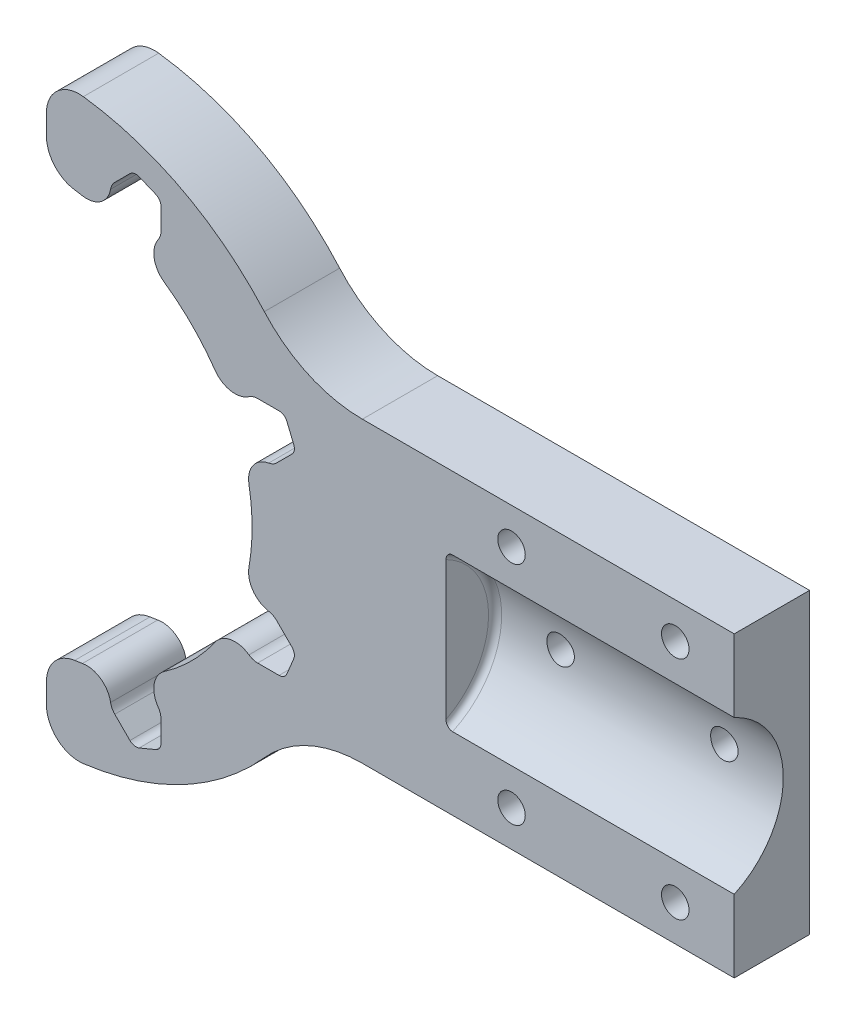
ISO-10303-21;
HEADER;
FILE_DESCRIPTION(('STEP AP214'),'2;1');
FILE_NAME('part.step','',(''),(''),'','','');
FILE_SCHEMA(('AUTOMOTIVE_DESIGN { 1 0 10303 214 1 1 1 1 }'));
ENDSEC;
DATA;
#1=APPLICATION_CONTEXT('core data for automotive mechanical design processes');
#2=APPLICATION_PROTOCOL_DEFINITION('international standard','automotive_design',2000,#1);
#3=PRODUCT_CONTEXT('',#1,'mechanical');
#4=PRODUCT('Part','Part','',(#3));
#5=PRODUCT_RELATED_PRODUCT_CATEGORY('part','',(#4));
#6=PRODUCT_DEFINITION_FORMATION('','',#4);
#7=PRODUCT_DEFINITION_CONTEXT('part definition',#1,'design');
#8=PRODUCT_DEFINITION('design','',#6,#7);
#9=PRODUCT_DEFINITION_SHAPE('','',#8);
#10=(LENGTH_UNIT() NAMED_UNIT(*) SI_UNIT(.MILLI.,.METRE.));
#11=(NAMED_UNIT(*) PLANE_ANGLE_UNIT() SI_UNIT($,.RADIAN.));
#12=(NAMED_UNIT(*) SI_UNIT($,.STERADIAN.) SOLID_ANGLE_UNIT());
#13=UNCERTAINTY_MEASURE_WITH_UNIT(LENGTH_MEASURE(1.E-05),#10,'distance_accuracy_value','');
#14=(GEOMETRIC_REPRESENTATION_CONTEXT(3) GLOBAL_UNCERTAINTY_ASSIGNED_CONTEXT((#13)) GLOBAL_UNIT_ASSIGNED_CONTEXT((#10,
#11,#12)) REPRESENTATION_CONTEXT('',''));
#15=CARTESIAN_POINT('',(0.,0.,0.));
#16=DIRECTION('',(0.,0.,1.));
#17=DIRECTION('',(1.,0.,0.));
#18=AXIS2_PLACEMENT_3D('',#15,#16,#17);
#19=CARTESIAN_POINT('',(50.,-22.75,-11.5));
#20=DIRECTION('',(0.,0.,1.));
#21=DIRECTION('',(1.,0.,0.));
#22=AXIS2_PLACEMENT_3D('',#19,#20,#21);
#23=PLANE('',#22);
#24=DIRECTION('',(0.,-1.,0.));
#25=VECTOR('',#24,1.);
#26=CARTESIAN_POINT('',(-55.,44.45,-11.5));
#27=LINE('',#26,#25);
#28=CARTESIAN_POINT('',(-55.,-36.0549580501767,-11.5));
#29=VERTEX_POINT('',#28);
#30=CARTESIAN_POINT('',(-55.,-39.1318604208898,-11.5));
#31=VERTEX_POINT('',#30);
#32=EDGE_CURVE('E757',#29,#31,#27,.T.);
#33=ORIENTED_EDGE('',*,*,#32,.F.);
#34=CARTESIAN_POINT('',(-50.,-36.0549580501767,-11.5));
#35=DIRECTION('',(0.,0.,1.));
#36=DIRECTION('',(1.,0.,0.));
#37=AXIS2_PLACEMENT_3D('',#34,#35,#36);
#38=CIRCLE('',#37,5.);
#39=CARTESIAN_POINT('',(-50.6868131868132,-31.1023539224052,-11.5));
#40=VERTEX_POINT('',#39);
#41=EDGE_CURVE('E1010',#29,#40,#38,.F.);
#42=ORIENTED_EDGE('',*,*,#41,.T.);
#43=CARTESIAN_POINT('',(-55.,0.,-11.5));
#44=DIRECTION('',(0.,0.,1.));
#45=DIRECTION('',(1.,0.,0.));
#46=AXIS2_PLACEMENT_3D('',#43,#44,#45);
#47=CIRCLE('',#46,31.4);
#48=CARTESIAN_POINT('',(-49.5008603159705,-30.9147127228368,-11.5));
#49=VERTEX_POINT('',#48);
#50=EDGE_CURVE('E744',#49,#40,#47,.F.);
#51=ORIENTED_EDGE('',*,*,#50,.F.);
#52=CARTESIAN_POINT('',(-48.8528725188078,-34.5575291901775,-11.5));
#53=DIRECTION('',(0.,0.,1.));
#54=DIRECTION('',(1.,0.,0.));
#55=AXIS2_PLACEMENT_3D('',#52,#53,#54);
#56=CIRCLE('',#55,3.70000000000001);
#57=CARTESIAN_POINT('',(-45.2071050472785,-33.9263560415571,-11.5));
#58=VERTEX_POINT('',#57);
#59=EDGE_CURVE('E1803',#49,#58,#56,.F.);
#60=ORIENTED_EDGE('',*,*,#59,.T.);
#61=CARTESIAN_POINT('',(-42.9408171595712,-33.5340051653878,-11.5));
#62=DIRECTION('',(0.,0.,1.));
#63=DIRECTION('',(1.,0.,0.));
#64=AXIS2_PLACEMENT_3D('',#61,#62,#63);
#65=CIRCLE('',#64,2.29999999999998);
#66=CARTESIAN_POINT('',(-44.5671627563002,-35.1603507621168,-11.5));
#67=VERTEX_POINT('',#66);
#68=EDGE_CURVE('E1811',#67,#58,#65,.F.);
#69=ORIENTED_EDGE('',*,*,#68,.F.);
#70=DIRECTION('',(-0.707106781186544,0.707106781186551,0.));
#71=VECTOR('',#70,1.);
#72=CARTESIAN_POINT('',(-39.8637567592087,-39.8637567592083,-11.5));
#73=LINE('',#72,#71);
#74=CARTESIAN_POINT('',(-42.2549235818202,-37.4725899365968,-11.5));
#75=VERTEX_POINT('',#74);
#76=EDGE_CURVE('E1800',#75,#67,#73,.T.);
#77=ORIENTED_EDGE('',*,*,#76,.F.);
#78=CARTESIAN_POINT('',(-41.3356847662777,-36.5533511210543,-11.5));
#79=DIRECTION('',(0.,0.,1.));
#80=DIRECTION('',(1.,0.,0.));
#81=AXIS2_PLACEMENT_3D('',#78,#79,#80);
#82=CIRCLE('',#81,1.29999999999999);
#83=CARTESIAN_POINT('',(-40.8381963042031,-37.754394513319,-11.5));
#84=VERTEX_POINT('',#83);
#85=EDGE_CURVE('E1794',#84,#75,#82,.F.);
#86=ORIENTED_EDGE('',*,*,#85,.F.);
#87=DIRECTION('',(-0.923879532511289,-0.382683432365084,0.));
#88=VECTOR('',#87,1.);
#89=CARTESIAN_POINT('',(7.36757880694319,-17.7869086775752,-11.5));
#90=LINE('',#89,#88);
#91=CARTESIAN_POINT('',(-38.3175190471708,-36.7102958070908,-11.5));
#92=VERTEX_POINT('',#91);
#93=EDGE_CURVE('E1824',#92,#84,#90,.T.);
#94=ORIENTED_EDGE('',*,*,#93,.F.);
#95=CARTESIAN_POINT('',(-38.8150075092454,-35.5092524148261,-11.5));
#96=DIRECTION('',(0.,0.,1.));
#97=DIRECTION('',(1.,0.,0.));
#98=AXIS2_PLACEMENT_3D('',#95,#96,#97);
#99=CIRCLE('',#98,1.3);
#100=CARTESIAN_POINT('',(-37.5150075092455,-35.5092524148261,-11.5));
#101=VERTEX_POINT('',#100);
#102=EDGE_CURVE('E1788',#101,#92,#99,.F.);
#103=ORIENTED_EDGE('',*,*,#102,.F.);
#104=DIRECTION('',(0.,-1.,0.));
#105=VECTOR('',#104,1.);
#106=CARTESIAN_POINT('',(-37.5150075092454,0.,-11.5));
#107=LINE('',#106,#105);
#108=CARTESIAN_POINT('',(-37.5150075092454,-32.2392524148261,-11.5));
#109=VERTEX_POINT('',#108);
#110=EDGE_CURVE('E1784',#109,#101,#107,.T.);
#111=ORIENTED_EDGE('',*,*,#110,.F.);
#112=CARTESIAN_POINT('',(-39.8150075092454,-32.2392524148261,-11.5));
#113=DIRECTION('',(0.,0.,1.));
#114=DIRECTION('',(1.,0.,0.));
#115=AXIS2_PLACEMENT_3D('',#112,#113,#114);
#116=CIRCLE('',#115,2.3);
#117=CARTESIAN_POINT('',(-37.9350660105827,-30.9141788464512,-11.5));
#118=VERTEX_POINT('',#117);
#119=EDGE_CURVE('E1829',#118,#109,#116,.F.);
#120=ORIENTED_EDGE('',*,*,#119,.F.);
#121=CARTESIAN_POINT('',(-34.9108122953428,-28.7825387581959,-11.5));
#122=DIRECTION('',(0.,0.,1.));
#123=DIRECTION('',(1.,0.,0.));
#124=AXIS2_PLACEMENT_3D('',#121,#122,#123);
#125=CIRCLE('',#124,3.69999999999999);
#126=CARTESIAN_POINT('',(-37.0284759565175,-25.7484819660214,-11.5));
#127=VERTEX_POINT('',#126);
#128=EDGE_CURVE('E1774',#118,#127,#125,.F.);
#129=ORIENTED_EDGE('',*,*,#128,.T.);
#130=CARTESIAN_POINT('',(-55.,0.,-11.5));
#131=DIRECTION('',(0.,0.,1.));
#132=DIRECTION('',(1.,0.,0.));
#133=AXIS2_PLACEMENT_3D('',#130,#131,#132);
#134=CIRCLE('',#133,31.4);
#135=CARTESIAN_POINT('',(-29.2515180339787,-17.9715240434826,-11.5));
#136=VERTEX_POINT('',#135);
#137=EDGE_CURVE('E1831',#136,#127,#134,.F.);
#138=ORIENTED_EDGE('',*,*,#137,.F.);
#139=CARTESIAN_POINT('',(-26.2174612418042,-20.0891877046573,-11.5));
#140=DIRECTION('',(0.,0.,1.));
#141=DIRECTION('',(1.,0.,0.));
#142=AXIS2_PLACEMENT_3D('',#139,#140,#141);
#143=CIRCLE('',#142,3.7);
#144=CARTESIAN_POINT('',(-24.0858211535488,-17.0649339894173,-11.5));
#145=VERTEX_POINT('',#144);
#146=EDGE_CURVE('E1766',#136,#145,#143,.F.);
#147=ORIENTED_EDGE('',*,*,#146,.T.);
#148=CARTESIAN_POINT('',(-22.7607475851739,-15.1849924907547,-11.5));
#149=DIRECTION('',(0.,0.,1.));
#150=DIRECTION('',(1.,0.,0.));
#151=AXIS2_PLACEMENT_3D('',#148,#149,#150);
#152=CIRCLE('',#151,2.3);
#153=CARTESIAN_POINT('',(-22.7607475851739,-17.4849924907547,-11.5));
#154=VERTEX_POINT('',#153);
#155=EDGE_CURVE('E1836',#154,#145,#152,.F.);
#156=ORIENTED_EDGE('',*,*,#155,.F.);
#157=DIRECTION('',(-1.,0.,0.));
#158=VECTOR('',#157,1.);
#159=CARTESIAN_POINT('',(0.,-17.4849924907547,-11.5));
#160=LINE('',#159,#158);
#161=CARTESIAN_POINT('',(-19.4907475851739,-17.4849924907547,-11.5));
#162=VERTEX_POINT('',#161);
#163=EDGE_CURVE('E1762',#162,#154,#160,.T.);
#164=ORIENTED_EDGE('',*,*,#163,.F.);
#165=CARTESIAN_POINT('',(-19.4907475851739,-16.1849924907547,-11.5));
#166=DIRECTION('',(0.,0.,1.));
#167=DIRECTION('',(1.,0.,0.));
#168=AXIS2_PLACEMENT_3D('',#165,#166,#167);
#169=CIRCLE('',#168,1.3);
#170=CARTESIAN_POINT('',(-18.2897041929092,-16.6824809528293,-11.5));
#171=VERTEX_POINT('',#170);
#172=EDGE_CURVE('E1760',#171,#162,#169,.F.);
#173=ORIENTED_EDGE('',*,*,#172,.F.);
#174=DIRECTION('',(-0.382683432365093,-0.923879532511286,0.));
#175=VECTOR('',#174,1.);
#176=CARTESIAN_POINT('',(-9.7130913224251,4.02329415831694,-11.5));
#177=LINE('',#176,#175);
#178=CARTESIAN_POINT('',(-17.245605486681,-14.161803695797,-11.5));
#179=VERTEX_POINT('',#178);
#180=EDGE_CURVE('E1842',#179,#171,#177,.T.);
#181=ORIENTED_EDGE('',*,*,#180,.F.);
#182=CARTESIAN_POINT('',(-18.4466488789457,-13.6643152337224,-11.5));
#183=DIRECTION('',(0.,0.,1.));
#184=DIRECTION('',(1.,0.,0.));
#185=AXIS2_PLACEMENT_3D('',#182,#183,#184);
#186=CIRCLE('',#185,1.3);
#187=CARTESIAN_POINT('',(-17.5274100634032,-12.7450764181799,-11.5));
#188=VERTEX_POINT('',#187);
#189=EDGE_CURVE('E1748',#188,#179,#186,.F.);
#190=ORIENTED_EDGE('',*,*,#189,.F.);
#191=DIRECTION('',(0.707106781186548,-0.707106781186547,0.));
#192=VECTOR('',#191,1.);
#193=CARTESIAN_POINT('',(-15.1362432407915,-15.1362432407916,-11.5));
#194=LINE('',#193,#192);
#195=CARTESIAN_POINT('',(-19.8396492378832,-10.4328372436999,-11.5));
#196=VERTEX_POINT('',#195);
#197=EDGE_CURVE('E1750',#196,#188,#194,.T.);
#198=ORIENTED_EDGE('',*,*,#197,.F.);
#199=CARTESIAN_POINT('',(-21.4659948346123,-12.0591828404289,-11.5));
#200=DIRECTION('',(0.,0.,1.));
#201=DIRECTION('',(1.,0.,0.));
#202=AXIS2_PLACEMENT_3D('',#199,#200,#201);
#203=CIRCLE('',#202,2.3);
#204=CARTESIAN_POINT('',(-21.0736439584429,-9.79289495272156,-11.5));
#205=VERTEX_POINT('',#204);
#206=EDGE_CURVE('E1852',#205,#196,#203,.F.);
#207=ORIENTED_EDGE('',*,*,#206,.F.);
#208=CARTESIAN_POINT('',(-20.4424708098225,-6.14712748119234,-11.5));
#209=DIRECTION('',(0.,0.,1.));
#210=DIRECTION('',(1.,0.,0.));
#211=AXIS2_PLACEMENT_3D('',#208,#209,#210);
#212=CIRCLE('',#211,3.69999999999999);
#213=CARTESIAN_POINT('',(-24.0852872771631,-5.49913968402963,-11.5));
#214=VERTEX_POINT('',#213);
#215=EDGE_CURVE('E1737',#205,#214,#212,.F.);
#216=ORIENTED_EDGE('',*,*,#215,.T.);
#217=CARTESIAN_POINT('',(-55.,0.,-11.5));
#218=DIRECTION('',(0.,0.,1.));
#219=DIRECTION('',(1.,0.,0.));
#220=AXIS2_PLACEMENT_3D('',#217,#218,#219);
#221=CIRCLE('',#220,31.4);
#222=CARTESIAN_POINT('',(-24.0852872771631,5.49913968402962,-11.5));
#223=VERTEX_POINT('',#222);
#224=EDGE_CURVE('E1860',#223,#214,#221,.F.);
#225=ORIENTED_EDGE('',*,*,#224,.F.);
#226=CARTESIAN_POINT('',(-20.4424708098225,6.14712748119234,-11.5));
#227=DIRECTION('',(0.,0.,1.));
#228=DIRECTION('',(1.,0.,0.));
#229=AXIS2_PLACEMENT_3D('',#226,#227,#228);
#230=CIRCLE('',#229,3.7);
#231=CARTESIAN_POINT('',(-21.0736439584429,9.79289495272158,-11.5));
#232=VERTEX_POINT('',#231);
#233=EDGE_CURVE('E1735',#223,#232,#230,.F.);
#234=ORIENTED_EDGE('',*,*,#233,.T.);
#235=CARTESIAN_POINT('',(-21.4659948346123,12.0591828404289,-11.5));
#236=DIRECTION('',(0.,0.,1.));
#237=DIRECTION('',(1.,0.,0.));
#238=AXIS2_PLACEMENT_3D('',#235,#236,#237);
#239=CIRCLE('',#238,2.29999999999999);
#240=CARTESIAN_POINT('',(-19.8396492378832,10.4328372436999,-11.5));
#241=VERTEX_POINT('',#240);
#242=EDGE_CURVE('E1865',#241,#232,#239,.F.);
#243=ORIENTED_EDGE('',*,*,#242,.F.);
#244=DIRECTION('',(-0.707106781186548,-0.707106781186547,0.));
#245=VECTOR('',#244,1.);
#246=CARTESIAN_POINT('',(-15.1362432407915,15.1362432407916,-11.5));
#247=LINE('',#246,#245);
#248=CARTESIAN_POINT('',(-17.5274100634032,12.7450764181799,-11.5));
#249=VERTEX_POINT('',#248);
#250=EDGE_CURVE('E1724',#249,#241,#247,.T.);
#251=ORIENTED_EDGE('',*,*,#250,.F.);
#252=CARTESIAN_POINT('',(-18.4466488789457,13.6643152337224,-11.5));
#253=DIRECTION('',(0.,0.,1.));
#254=DIRECTION('',(1.,0.,0.));
#255=AXIS2_PLACEMENT_3D('',#252,#253,#254);
#256=CIRCLE('',#255,1.3);
#257=CARTESIAN_POINT('',(-17.245605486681,14.161803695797,-11.5));
#258=VERTEX_POINT('',#257);
#259=EDGE_CURVE('E1722',#258,#249,#256,.F.);
#260=ORIENTED_EDGE('',*,*,#259,.F.);
#261=DIRECTION('',(0.38268343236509,-0.923879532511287,0.));
#262=VECTOR('',#261,1.);
#263=CARTESIAN_POINT('',(-9.71309132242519,-4.02329415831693,-11.5));
#264=LINE('',#263,#262);
#265=CARTESIAN_POINT('',(-18.2897041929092,16.6824809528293,-11.5));
#266=VERTEX_POINT('',#265);
#267=EDGE_CURVE('E1867',#266,#258,#264,.T.);
#268=ORIENTED_EDGE('',*,*,#267,.F.);
#269=CARTESIAN_POINT('',(-19.4907475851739,16.1849924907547,-11.5));
#270=DIRECTION('',(0.,0.,1.));
#271=DIRECTION('',(1.,0.,0.));
#272=AXIS2_PLACEMENT_3D('',#269,#270,#271);
#273=CIRCLE('',#272,1.3);
#274=CARTESIAN_POINT('',(-19.4907475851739,17.4849924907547,-11.5));
#275=VERTEX_POINT('',#274);
#276=EDGE_CURVE('E1713',#275,#266,#273,.F.);
#277=ORIENTED_EDGE('',*,*,#276,.F.);
#278=DIRECTION('',(1.,0.,0.));
#279=VECTOR('',#278,1.);
#280=CARTESIAN_POINT('',(0.,17.4849924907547,-11.5));
#281=LINE('',#280,#279);
#282=CARTESIAN_POINT('',(-22.7607475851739,17.4849924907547,-11.5));
#283=VERTEX_POINT('',#282);
#284=EDGE_CURVE('E1714',#283,#275,#281,.T.);
#285=ORIENTED_EDGE('',*,*,#284,.F.);
#286=CARTESIAN_POINT('',(-22.7607475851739,15.1849924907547,-11.5));
#287=DIRECTION('',(0.,0.,1.));
#288=DIRECTION('',(1.,0.,0.));
#289=AXIS2_PLACEMENT_3D('',#286,#287,#288);
#290=CIRCLE('',#289,2.30000000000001);
#291=CARTESIAN_POINT('',(-24.0858211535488,17.0649339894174,-11.5));
#292=VERTEX_POINT('',#291);
#293=EDGE_CURVE('E1877',#292,#283,#290,.F.);
#294=ORIENTED_EDGE('',*,*,#293,.F.);
#295=CARTESIAN_POINT('',(-26.2174612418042,20.0891877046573,-11.5));
#296=DIRECTION('',(0.,0.,1.));
#297=DIRECTION('',(1.,0.,0.));
#298=AXIS2_PLACEMENT_3D('',#295,#296,#297);
#299=CIRCLE('',#298,3.69999999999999);
#300=CARTESIAN_POINT('',(-29.2515180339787,17.9715240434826,-11.5));
#301=VERTEX_POINT('',#300);
#302=EDGE_CURVE('E1701',#292,#301,#299,.F.);
#303=ORIENTED_EDGE('',*,*,#302,.T.);
#304=CARTESIAN_POINT('',(-55.,0.,-11.5));
#305=DIRECTION('',(0.,0.,1.));
#306=DIRECTION('',(1.,0.,0.));
#307=AXIS2_PLACEMENT_3D('',#304,#305,#306);
#308=CIRCLE('',#307,31.4);
#309=CARTESIAN_POINT('',(-37.0284759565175,25.7484819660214,-11.5));
#310=VERTEX_POINT('',#309);
#311=EDGE_CURVE('E1883',#310,#301,#308,.F.);
#312=ORIENTED_EDGE('',*,*,#311,.F.);
#313=CARTESIAN_POINT('',(-34.9108122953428,28.7825387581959,-11.5));
#314=DIRECTION('',(0.,0.,1.));
#315=DIRECTION('',(1.,0.,0.));
#316=AXIS2_PLACEMENT_3D('',#313,#314,#315);
#317=CIRCLE('',#316,3.7);
#318=CARTESIAN_POINT('',(-37.9350660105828,30.9141788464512,-11.5));
#319=VERTEX_POINT('',#318);
#320=EDGE_CURVE('E1697',#310,#319,#317,.F.);
#321=ORIENTED_EDGE('',*,*,#320,.T.);
#322=CARTESIAN_POINT('',(-39.8150075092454,32.2392524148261,-11.5));
#323=DIRECTION('',(0.,0.,1.));
#324=DIRECTION('',(1.,0.,0.));
#325=AXIS2_PLACEMENT_3D('',#322,#323,#324);
#326=CIRCLE('',#325,2.29999999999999);
#327=CARTESIAN_POINT('',(-37.5150075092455,32.2392524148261,-11.5));
#328=VERTEX_POINT('',#327);
#329=EDGE_CURVE('E1889',#328,#319,#326,.F.);
#330=ORIENTED_EDGE('',*,*,#329,.F.);
#331=DIRECTION('',(0.,-1.,0.));
#332=VECTOR('',#331,1.);
#333=CARTESIAN_POINT('',(-37.5150075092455,0.,-11.5));
#334=LINE('',#333,#332);
#335=CARTESIAN_POINT('',(-37.5150075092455,35.5092524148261,-11.5));
#336=VERTEX_POINT('',#335);
#337=EDGE_CURVE('E1687',#336,#328,#334,.T.);
#338=ORIENTED_EDGE('',*,*,#337,.F.);
#339=CARTESIAN_POINT('',(-38.8150075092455,35.5092524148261,-11.5));
#340=DIRECTION('',(0.,0.,1.));
#341=DIRECTION('',(1.,0.,0.));
#342=AXIS2_PLACEMENT_3D('',#339,#340,#341);
#343=CIRCLE('',#342,1.3);
#344=CARTESIAN_POINT('',(-38.3175190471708,36.7102958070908,-11.5));
#345=VERTEX_POINT('',#344);
#346=EDGE_CURVE('E1688',#345,#336,#343,.F.);
#347=ORIENTED_EDGE('',*,*,#346,.F.);
#348=DIRECTION('',(0.923879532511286,-0.382683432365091,0.));
#349=VECTOR('',#348,1.);
#350=CARTESIAN_POINT('',(7.36757880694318,17.7869086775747,-11.5));
#351=LINE('',#350,#349);
#352=CARTESIAN_POINT('',(-40.8381963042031,37.754394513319,-11.5));
#353=VERTEX_POINT('',#352);
#354=EDGE_CURVE('E1894',#353,#345,#351,.T.);
#355=ORIENTED_EDGE('',*,*,#354,.F.);
#356=CARTESIAN_POINT('',(-41.3356847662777,36.5533511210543,-11.5));
#357=DIRECTION('',(0.,0.,1.));
#358=DIRECTION('',(1.,0.,0.));
#359=AXIS2_PLACEMENT_3D('',#356,#357,#358);
#360=CIRCLE('',#359,1.30000000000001);
#361=CARTESIAN_POINT('',(-42.2549235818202,37.4725899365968,-11.5));
#362=VERTEX_POINT('',#361);
#363=EDGE_CURVE('E1677',#362,#353,#360,.F.);
#364=ORIENTED_EDGE('',*,*,#363,.F.);
#365=DIRECTION('',(0.707106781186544,0.707106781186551,0.));
#366=VECTOR('',#365,1.);
#367=CARTESIAN_POINT('',(-39.8637567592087,39.8637567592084,-11.5));
#368=LINE('',#367,#366);
#369=CARTESIAN_POINT('',(-44.5671627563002,35.1603507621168,-11.5));
#370=VERTEX_POINT('',#369);
#371=EDGE_CURVE('E1674',#370,#362,#368,.T.);
#372=ORIENTED_EDGE('',*,*,#371,.F.);
#373=CARTESIAN_POINT('',(-42.9408171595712,33.5340051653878,-11.5));
#374=DIRECTION('',(0.,0.,1.));
#375=DIRECTION('',(1.,0.,0.));
#376=AXIS2_PLACEMENT_3D('',#373,#374,#375);
#377=CIRCLE('',#376,2.3);
#378=CARTESIAN_POINT('',(-45.2071050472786,33.9263560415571,-11.5));
#379=VERTEX_POINT('',#378);
#380=EDGE_CURVE('E1668',#379,#370,#377,.F.);
#381=ORIENTED_EDGE('',*,*,#380,.F.);
#382=CARTESIAN_POINT('',(-48.8528725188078,34.5575291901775,-11.5));
#383=DIRECTION('',(0.,0.,1.));
#384=DIRECTION('',(1.,0.,0.));
#385=AXIS2_PLACEMENT_3D('',#382,#383,#384);
#386=CIRCLE('',#385,3.69999999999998);
#387=CARTESIAN_POINT('',(-49.5008603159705,30.9147127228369,-11.5));
#388=VERTEX_POINT('',#387);
#389=EDGE_CURVE('E1025',#379,#388,#386,.F.);
#390=ORIENTED_EDGE('',*,*,#389,.T.);
#391=CARTESIAN_POINT('',(-55.,0.,-11.5));
#392=DIRECTION('',(0.,0.,1.));
#393=DIRECTION('',(1.,0.,0.));
#394=AXIS2_PLACEMENT_3D('',#391,#392,#393);
#395=CIRCLE('',#394,31.4);
#396=CARTESIAN_POINT('',(-50.6868131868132,31.1023539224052,-11.5));
#397=VERTEX_POINT('',#396);
#398=EDGE_CURVE('E418',#397,#388,#395,.F.);
#399=ORIENTED_EDGE('',*,*,#398,.F.);
#400=CARTESIAN_POINT('',(-50.,36.0549580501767,-11.5));
#401=DIRECTION('',(0.,0.,1.));
#402=DIRECTION('',(1.,0.,0.));
#403=AXIS2_PLACEMENT_3D('',#400,#401,#402);
#404=CIRCLE('',#403,5.);
#405=CARTESIAN_POINT('',(-55.,36.0549580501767,-11.5));
#406=VERTEX_POINT('',#405);
#407=EDGE_CURVE('E1021',#397,#406,#404,.F.);
#408=ORIENTED_EDGE('',*,*,#407,.T.);
#409=CARTESIAN_POINT('',(-55.,39.1318604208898,-11.5));
#410=VERTEX_POINT('',#409);
#411=EDGE_CURVE('E761',#410,#406,#27,.T.);
#412=ORIENTED_EDGE('',*,*,#411,.F.);
#413=CARTESIAN_POINT('',(-50.,39.1318604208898,-11.5));
#414=DIRECTION('',(0.,0.,1.));
#415=DIRECTION('',(1.,0.,0.));
#416=AXIS2_PLACEMENT_3D('',#413,#414,#415);
#417=CIRCLE('',#416,5.);
#418=CARTESIAN_POINT('',(-49.3662864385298,44.0915385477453,-11.5));
#419=VERTEX_POINT('',#418);
#420=EDGE_CURVE('E73',#410,#419,#417,.F.);
#421=ORIENTED_EDGE('',*,*,#420,.T.);
#422=CARTESIAN_POINT('',(-55.,0.,-11.5));
#423=DIRECTION('',(0.,0.,1.));
#424=DIRECTION('',(-1.,0.,0.));
#425=AXIS2_PLACEMENT_3D('',#422,#423,#424);
#426=CIRCLE('',#425,44.45);
#427=CARTESIAN_POINT('',(-21.7358750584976,29.4839022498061,-11.5));
#428=VERTEX_POINT('',#427);
#429=EDGE_CURVE('E756',#428,#419,#426,.T.);
#430=ORIENTED_EDGE('',*,*,#429,.F.);
#431=CARTESIAN_POINT('',(-6.76888970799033,42.75,-11.5));
#432=DIRECTION('',(0.,0.,1.));
#433=DIRECTION('',(1.,0.,0.));
#434=AXIS2_PLACEMENT_3D('',#431,#432,#433);
#435=CIRCLE('',#434,20.);
#436=CARTESIAN_POINT('',(-6.76888970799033,22.75,-11.5));
#437=VERTEX_POINT('',#436);
#438=EDGE_CURVE('E842',#428,#437,#435,.T.);
#439=ORIENTED_EDGE('',*,*,#438,.T.);
#440=DIRECTION('',(-1.,0.,0.));
#441=VECTOR('',#440,1.);
#442=CARTESIAN_POINT('',(50.,22.75,-11.5));
#443=LINE('',#442,#441);
#444=CARTESIAN_POINT('',(50.,22.75,-11.5));
#445=VERTEX_POINT('',#444);
#446=EDGE_CURVE('E803',#445,#437,#443,.T.);
#447=ORIENTED_EDGE('',*,*,#446,.F.);
#448=DIRECTION('',(0.,1.,0.));
#449=VECTOR('',#448,1.);
#450=CARTESIAN_POINT('',(50.,-22.75,-11.5));
#451=LINE('',#450,#449);
#452=CARTESIAN_POINT('',(50.,-22.75,-11.5));
#453=VERTEX_POINT('',#452);
#454=EDGE_CURVE('E790',#453,#445,#451,.T.);
#455=ORIENTED_EDGE('',*,*,#454,.F.);
#456=DIRECTION('',(-1.,0.,0.));
#457=VECTOR('',#456,1.);
#458=CARTESIAN_POINT('',(50.,-22.75,-11.5));
#459=LINE('',#458,#457);
#460=CARTESIAN_POINT('',(-6.76888970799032,-22.75,-11.5));
#461=VERTEX_POINT('',#460);
#462=EDGE_CURVE('E809',#453,#461,#459,.T.);
#463=ORIENTED_EDGE('',*,*,#462,.T.);
#464=CARTESIAN_POINT('',(-6.76888970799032,-42.75,-11.5));
#465=DIRECTION('',(0.,0.,1.));
#466=DIRECTION('',(1.,0.,0.));
#467=AXIS2_PLACEMENT_3D('',#464,#465,#466);
#468=CIRCLE('',#467,20.);
#469=CARTESIAN_POINT('',(-21.7358750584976,-29.483902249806,-11.5));
#470=VERTEX_POINT('',#469);
#471=EDGE_CURVE('E840',#461,#470,#468,.T.);
#472=ORIENTED_EDGE('',*,*,#471,.T.);
#473=CARTESIAN_POINT('',(-55.,0.,-11.5));
#474=DIRECTION('',(0.,0.,1.));
#475=DIRECTION('',(-1.,0.,0.));
#476=AXIS2_PLACEMENT_3D('',#473,#474,#475);
#477=CIRCLE('',#476,44.45);
#478=CARTESIAN_POINT('',(-49.3662864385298,-44.0915385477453,-11.5));
#479=VERTEX_POINT('',#478);
#480=EDGE_CURVE('E764',#479,#470,#477,.T.);
#481=ORIENTED_EDGE('',*,*,#480,.F.);
#482=CARTESIAN_POINT('',(-50.,-39.1318604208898,-11.5));
#483=DIRECTION('',(0.,0.,1.));
#484=DIRECTION('',(1.,0.,0.));
#485=AXIS2_PLACEMENT_3D('',#482,#483,#484);
#486=CIRCLE('',#485,5.);
#487=EDGE_CURVE('E1008',#479,#31,#486,.F.);
#488=ORIENTED_EDGE('',*,*,#487,.T.);
#489=EDGE_LOOP('',(#33,#42,#51,#60,#69,#77,#86,#94,#103,#111,#120,#129,#138,#147,#156,#164,#173,
#181,#190,#198,#207,#216,#225,#234,#243,#251,#260,#268,#277,#285,#294,#303,#312,#321,#330,#338,
#347,#355,#364,#372,#381,#390,#399,#408,#412,#421,#430,#439,#447,#455,#463,#472,#481,#488));
#490=FACE_BOUND('',#489,.T.);
#491=CARTESIAN_POINT('',(41.,-17.25,-11.5));
#492=DIRECTION('',(0.,0.,1.));
#493=DIRECTION('',(1.,0.,0.));
#494=AXIS2_PLACEMENT_3D('',#491,#492,#493);
#495=CIRCLE('',#494,2.1);
#496=CARTESIAN_POINT('',(43.1,-17.25,-11.5));
#497=VERTEX_POINT('',#496);
#498=EDGE_CURVE('E738',#497,#497,#495,.T.);
#499=ORIENTED_EDGE('',*,*,#498,.T.);
#500=EDGE_LOOP('',(#499));
#501=FACE_BOUND('',#500,.T.);
#502=CARTESIAN_POINT('',(16.,-17.25,-11.5));
#503=DIRECTION('',(0.,0.,1.));
#504=DIRECTION('',(1.,0.,0.));
#505=AXIS2_PLACEMENT_3D('',#502,#503,#504);
#506=CIRCLE('',#505,2.1);
#507=CARTESIAN_POINT('',(18.1,-17.25,-11.5));
#508=VERTEX_POINT('',#507);
#509=EDGE_CURVE('E733',#508,#508,#506,.T.);
#510=ORIENTED_EDGE('',*,*,#509,.T.);
#511=EDGE_LOOP('',(#510));
#512=FACE_BOUND('',#511,.T.);
#513=CARTESIAN_POINT('',(16.,17.25,-11.5));
#514=DIRECTION('',(0.,0.,1.));
#515=DIRECTION('',(1.,0.,0.));
#516=AXIS2_PLACEMENT_3D('',#513,#514,#515);
#517=CIRCLE('',#516,2.1);
#518=CARTESIAN_POINT('',(18.1,17.25,-11.5));
#519=VERTEX_POINT('',#518);
#520=EDGE_CURVE('E724',#519,#519,#517,.T.);
#521=ORIENTED_EDGE('',*,*,#520,.T.);
#522=EDGE_LOOP('',(#521));
#523=FACE_BOUND('',#522,.T.);
#524=CARTESIAN_POINT('',(41.,17.25,-11.5));
#525=DIRECTION('',(0.,0.,1.));
#526=DIRECTION('',(1.,0.,0.));
#527=AXIS2_PLACEMENT_3D('',#524,#525,#526);
#528=CIRCLE('',#527,2.1);
#529=CARTESIAN_POINT('',(43.1,17.25,-11.5));
#530=VERTEX_POINT('',#529);
#531=EDGE_CURVE('E741',#530,#530,#528,.T.);
#532=ORIENTED_EDGE('',*,*,#531,.T.);
#533=EDGE_LOOP('',(#532));
#534=FACE_BOUND('',#533,.T.);
#535=CARTESIAN_POINT('',(41.,0.,-11.500012));
#536=DIRECTION('',(0.,0.,-1.));
#537=DIRECTION('',(-1.,0.,0.));
#538=AXIS2_PLACEMENT_3D('',#535,#536,#537);
#539=CIRCLE('',#538,2.1);
#540=CARTESIAN_POINT('',(38.9,0.,-11.500012));
#541=VERTEX_POINT('',#540);
#542=EDGE_CURVE('E932',#541,#541,#539,.T.);
#543=ORIENTED_EDGE('',*,*,#542,.F.);
#544=EDGE_LOOP('',(#543));
#545=FACE_BOUND('',#544,.T.);
#546=CARTESIAN_POINT('',(16.,0.,-11.500012));
#547=DIRECTION('',(0.,0.,-1.));
#548=DIRECTION('',(-1.,0.,0.));
#549=AXIS2_PLACEMENT_3D('',#546,#547,#548);
#550=CIRCLE('',#549,2.1);
#551=CARTESIAN_POINT('',(13.9,0.,-11.500012));
#552=VERTEX_POINT('',#551);
#553=EDGE_CURVE('E929',#552,#552,#550,.T.);
#554=ORIENTED_EDGE('',*,*,#553,.F.);
#555=EDGE_LOOP('',(#554));
#556=FACE_BOUND('',#555,.T.);
#557=ADVANCED_FACE('F50',(#490,#501,#512,#523,#534,#545,#556),#23,.F.);
#558=CARTESIAN_POINT('',(-55.,44.45,-11.5));
#559=DIRECTION('',(-1.,0.,0.));
#560=DIRECTION('',(0.,0.,1.));
#561=AXIS2_PLACEMENT_3D('',#558,#559,#560);
#562=PLANE('',#561);
#563=DIRECTION('',(0.,-1.,0.));
#564=VECTOR('',#563,1.);
#565=CARTESIAN_POINT('',(-55.,44.45,0.));
#566=LINE('',#565,#564);
#567=CARTESIAN_POINT('',(-55.,-36.0549580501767,0.));
#568=VERTEX_POINT('',#567);
#569=CARTESIAN_POINT('',(-55.,-39.1318604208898,0.));
#570=VERTEX_POINT('',#569);
#571=EDGE_CURVE('E775',#568,#570,#566,.T.);
#572=ORIENTED_EDGE('',*,*,#571,.F.);
#573=DIRECTION('',(0.,0.,-1.));
#574=VECTOR('',#573,1.);
#575=CARTESIAN_POINT('',(-55.,-36.0549580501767,-11.5));
#576=LINE('',#575,#574);
#577=EDGE_CURVE('E1028',#568,#29,#576,.T.);
#578=ORIENTED_EDGE('',*,*,#577,.T.);
#579=ORIENTED_EDGE('',*,*,#32,.T.);
#580=DIRECTION('',(0.,0.,1.));
#581=VECTOR('',#580,1.);
#582=CARTESIAN_POINT('',(-55.,-39.1318604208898,-11.5));
#583=LINE('',#582,#581);
#584=EDGE_CURVE('E1031',#31,#570,#583,.T.);
#585=ORIENTED_EDGE('',*,*,#584,.T.);
#586=EDGE_LOOP('',(#572,#578,#579,#585));
#587=FACE_BOUND('',#586,.T.);
#588=ADVANCED_FACE('F898',(#587),#562,.T.);
#589=CARTESIAN_POINT('',(50.,0.,5.35));
#590=DIRECTION('',(-1.,0.,0.));
#591=DIRECTION('',(0.,0.,1.));
#592=AXIS2_PLACEMENT_3D('',#589,#590,#591);
#593=CYLINDRICAL_SURFACE('',#592,12.85);
#594=CARTESIAN_POINT('',(13.9,0.,-7.5));
#595=CARTESIAN_POINT('',(13.9000047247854,0.117121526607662,-7.49999801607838));
#596=CARTESIAN_POINT('',(13.9098312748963,0.234307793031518,-7.49838204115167));
#597=CARTESIAN_POINT('',(13.9488627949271,0.465395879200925,-7.49209118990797));
#598=CARTESIAN_POINT('',(13.9780857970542,0.57929453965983,-7.48741346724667));
#599=CARTESIAN_POINT('',(14.0550062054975,0.800430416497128,-7.47552399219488));
#600=CARTESIAN_POINT('',(14.1026887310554,0.907672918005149,-7.46831428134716));
#601=CARTESIAN_POINT('',(14.2151362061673,1.11262082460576,-7.45215435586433));
#602=CARTESIAN_POINT('',(14.2798991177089,1.21032736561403,-7.44320434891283));
#603=CARTESIAN_POINT('',(14.4253034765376,1.3943436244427,-7.42446448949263));
#604=CARTESIAN_POINT('',(14.5060713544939,1.48055280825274,-7.41466832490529));
#605=CARTESIAN_POINT('',(14.680920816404,1.63825897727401,-7.39538877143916));
#606=CARTESIAN_POINT('',(14.775003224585,1.70975505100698,-7.38590540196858));
#607=CARTESIAN_POINT('',(14.9744986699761,1.83640607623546,-7.36826403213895));
#608=CARTESIAN_POINT('',(15.0799753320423,1.89146204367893,-7.36011418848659));
#609=CARTESIAN_POINT('',(15.2988349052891,1.98303711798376,-7.34614992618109));
#610=CARTESIAN_POINT('',(15.4122173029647,2.01955742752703,-7.34033535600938));
#611=CARTESIAN_POINT('',(15.6426057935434,2.07270865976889,-7.33176266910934));
#612=CARTESIAN_POINT('',(15.7595709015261,2.08951286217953,-7.32897793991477));
#613=CARTESIAN_POINT('',(15.9946912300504,2.10329203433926,-7.32669967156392));
#614=CARTESIAN_POINT('',(16.1128463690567,2.10026835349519,-7.32720590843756));
#615=CARTESIAN_POINT('',(16.345758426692,2.07461882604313,-7.33142806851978));
#616=CARTESIAN_POINT('',(16.4605374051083,2.05218729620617,-7.33511217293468));
#617=CARTESIAN_POINT('',(16.6846804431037,1.98866361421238,-7.34522517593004));
#618=CARTESIAN_POINT('',(16.7940443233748,1.94757084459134,-7.35165416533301));
#619=CARTESIAN_POINT('',(17.0048363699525,1.84769311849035,-7.36656708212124));
#620=CARTESIAN_POINT('',(17.1062254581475,1.78882714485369,-7.37506038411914));
#621=CARTESIAN_POINT('',(17.2977604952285,1.65513155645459,-7.39313838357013));
#622=CARTESIAN_POINT('',(17.387905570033,1.58030070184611,-7.40272316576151));
#623=CARTESIAN_POINT('',(17.5555187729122,1.41573919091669,-7.42204413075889));
#624=CARTESIAN_POINT('',(17.6328231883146,1.32584174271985,-7.43178075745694));
#625=CARTESIAN_POINT('',(17.7712743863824,1.13426388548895,-7.45020275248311));
#626=CARTESIAN_POINT('',(17.8324210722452,1.03258340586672,-7.45888811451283));
#627=CARTESIAN_POINT('',(17.9368346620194,0.82017432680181,-7.47424062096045));
#628=CARTESIAN_POINT('',(17.9800874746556,0.70943867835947,-7.48090617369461));
#629=CARTESIAN_POINT('',(18.0473355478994,0.482141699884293,-7.4914551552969));
#630=CARTESIAN_POINT('',(18.071332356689,0.365580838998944,-7.49533880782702));
#631=CARTESIAN_POINT('',(18.0991661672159,0.13135360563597,-7.49985642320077));
#632=CARTESIAN_POINT('',(18.1032279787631,0.0137146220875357,-7.50052662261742));
#633=CARTESIAN_POINT('',(18.0916753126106,-0.220563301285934,-7.49864094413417));
#634=CARTESIAN_POINT('',(18.0760615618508,-0.337202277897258,-7.49608518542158));
#635=CARTESIAN_POINT('',(18.0257879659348,-0.565477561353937,-7.48805718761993));
#636=CARTESIAN_POINT('',(17.9912390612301,-0.67713895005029,-7.4826019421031));
#637=CARTESIAN_POINT('',(17.904193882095,-0.893084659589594,-7.46938429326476));
#638=CARTESIAN_POINT('',(17.8516966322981,-0.997368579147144,-7.46162176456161));
#639=CARTESIAN_POINT('',(17.7297275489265,-1.19657805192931,-7.44456106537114));
#640=CARTESIAN_POINT('',(17.6601148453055,-1.29141626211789,-7.43525036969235));
#641=CARTESIAN_POINT('',(17.506085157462,-1.46814485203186,-7.41616490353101));
#642=CARTESIAN_POINT('',(17.4216671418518,-1.55003432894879,-7.40639010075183));
#643=CARTESIAN_POINT('',(17.2394163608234,-1.69937114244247,-7.38736138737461));
#644=CARTESIAN_POINT('',(17.1414585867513,-1.76666682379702,-7.37811362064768));
#645=CARTESIAN_POINT('',(16.9354969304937,-1.88384763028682,-7.36129958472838));
#646=CARTESIAN_POINT('',(16.8274933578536,-1.93373329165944,-7.35373326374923));
#647=CARTESIAN_POINT('',(16.6049356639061,-2.01444949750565,-7.34118458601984));
#648=CARTESIAN_POINT('',(16.490409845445,-2.04535640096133,-7.3361918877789));
#649=CARTESIAN_POINT('',(16.2577041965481,-2.0874786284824,-7.3293294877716));
#650=CARTESIAN_POINT('',(16.1395246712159,-2.09869559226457,-7.32745952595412));
#651=CARTESIAN_POINT('',(15.9043800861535,-2.10107515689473,-7.32706523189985));
#652=CARTESIAN_POINT('',(15.7874174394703,-2.09247641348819,-7.32850108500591));
#653=CARTESIAN_POINT('',(15.5566266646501,-2.05598376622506,-7.33446952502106));
#654=CARTESIAN_POINT('',(15.4427985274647,-2.02808991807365,-7.33900210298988));
#655=CARTESIAN_POINT('',(15.221594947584,-1.9538888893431,-7.35063839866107));
#656=CARTESIAN_POINT('',(15.1142127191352,-1.9076014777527,-7.35773935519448));
#657=CARTESIAN_POINT('',(14.9086994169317,-1.79795159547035,-7.37371511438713));
#658=CARTESIAN_POINT('',(14.8105687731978,-1.73458833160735,-7.38258999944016));
#659=CARTESIAN_POINT('',(14.6251370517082,-1.59173052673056,-7.40124023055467));
#660=CARTESIAN_POINT('',(14.5379723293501,-1.51206016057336,-7.41102469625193));
#661=CARTESIAN_POINT('',(14.3781668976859,-1.33922073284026,-7.43031820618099));
#662=CARTESIAN_POINT('',(14.3055295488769,-1.24604855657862,-7.43982718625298));
#663=CARTESIAN_POINT('',(14.176403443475,-1.0481190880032,-7.45757102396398));
#664=CARTESIAN_POINT('',(14.1200246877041,-0.943289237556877,-7.46579703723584));
#665=CARTESIAN_POINT('',(14.0257628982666,-0.72555668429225,-7.47996193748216));
#666=CARTESIAN_POINT('',(13.9878612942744,-0.612662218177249,-7.48590311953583));
#667=CARTESIAN_POINT('',(13.939931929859,-0.416095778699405,-7.4935203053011));
#668=CARTESIAN_POINT('',(13.9249812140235,-0.333618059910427,-7.49593730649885));
#669=CARTESIAN_POINT('',(13.9050136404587,-0.167437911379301,-7.49917785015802));
#670=CARTESIAN_POINT('',(13.8999966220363,-0.0837355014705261,-7.50000141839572));
#671=CARTESIAN_POINT('',(13.9,0.,-7.5));
#672=B_SPLINE_CURVE_WITH_KNOTS('',3,(#594,#595,#596,#597,#598,#599,#600,#601,#602,#603,#604,
#605,#606,#607,#608,#609,#610,#611,#612,#613,#614,#615,#616,#617,#618,#619,#620,#621,#622,#623,
#624,#625,#626,#627,#628,#629,#630,#631,#632,#633,#634,#635,#636,#637,#638,#639,#640,#641,#642,
#643,#644,#645,#646,#647,#648,#649,#650,#651,#652,#653,#654,#655,#656,#657,#658,#659,#660,#661,
#662,#663,#664,#665,#666,#667,#668,#669,#670,#671),.UNSPECIFIED.,.T.,.F.,(4,2,2,2,2,2,2,2,2,2,2,
2,2,2,2,2,2,2,2,2,2,2,2,2,2,2,2,2,2,2,2,2,2,2,2,2,2,2,4),(0.,0.351058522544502,
0.702443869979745,1.05354654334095,1.40460734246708,1.75856061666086,2.11253581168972,
2.46860116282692,2.82464340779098,3.17753247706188,3.53039753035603,3.87976995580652,
4.22915394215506,4.58015523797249,4.93118380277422,5.28639177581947,5.64160187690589,
5.99709117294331,6.35255188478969,6.70399465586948,7.05542444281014,7.40481689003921,
7.75422832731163,8.10661799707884,8.45903222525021,8.81494965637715,9.17085612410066,
9.52532109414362,9.87975654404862,10.2299456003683,10.5801336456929,10.9299463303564,
11.2797752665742,11.6335961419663,11.9874987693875,12.343742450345,12.6996273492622,
12.9506190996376,13.2016067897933),.UNSPECIFIED.);
#673=CARTESIAN_POINT('',(13.9,0.,-7.5));
#674=VERTEX_POINT('',#673);
#675=EDGE_CURVE('E437',#674,#674,#672,.T.);
#676=ORIENTED_EDGE('',*,*,#675,.T.);
#677=EDGE_LOOP('',(#676));
#678=FACE_BOUND('',#677,.T.);
#679=CARTESIAN_POINT('',(38.9,0.,-7.5));
#680=CARTESIAN_POINT('',(38.9000047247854,0.117121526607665,-7.49999801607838));
#681=CARTESIAN_POINT('',(38.9098312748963,0.234307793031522,-7.49838204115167));
#682=CARTESIAN_POINT('',(38.9488627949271,0.465395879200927,-7.49209118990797));
#683=CARTESIAN_POINT('',(38.9780857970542,0.579294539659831,-7.48741346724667));
#684=CARTESIAN_POINT('',(39.0550062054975,0.800430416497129,-7.47552399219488));
#685=CARTESIAN_POINT('',(39.1026887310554,0.907672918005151,-7.46831428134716));
#686=CARTESIAN_POINT('',(39.2151362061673,1.11262082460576,-7.45215435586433));
#687=CARTESIAN_POINT('',(39.2798991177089,1.21032736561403,-7.44320434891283));
#688=CARTESIAN_POINT('',(39.4253034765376,1.3943436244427,-7.42446448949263));
#689=CARTESIAN_POINT('',(39.506071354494,1.48055280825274,-7.41466832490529));
#690=CARTESIAN_POINT('',(39.680920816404,1.63825897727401,-7.39538877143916));
#691=CARTESIAN_POINT('',(39.775003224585,1.70975505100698,-7.38590540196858));
#692=CARTESIAN_POINT('',(39.9744986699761,1.83640607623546,-7.36826403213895));
#693=CARTESIAN_POINT('',(40.0799753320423,1.89146204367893,-7.36011418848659));
#694=CARTESIAN_POINT('',(40.2988349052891,1.98303711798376,-7.34614992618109));
#695=CARTESIAN_POINT('',(40.4122173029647,2.01955742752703,-7.34033535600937));
#696=CARTESIAN_POINT('',(40.6426057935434,2.07270865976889,-7.33176266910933));
#697=CARTESIAN_POINT('',(40.7595709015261,2.08951286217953,-7.32897793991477));
#698=CARTESIAN_POINT('',(40.9946912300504,2.10329203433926,-7.32669967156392));
#699=CARTESIAN_POINT('',(41.1128463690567,2.1002683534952,-7.32720590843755));
#700=CARTESIAN_POINT('',(41.345758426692,2.07461882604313,-7.33142806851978));
#701=CARTESIAN_POINT('',(41.4605374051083,2.05218729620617,-7.33511217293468));
#702=CARTESIAN_POINT('',(41.6846804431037,1.98866361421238,-7.34522517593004));
#703=CARTESIAN_POINT('',(41.7940443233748,1.94757084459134,-7.35165416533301));
#704=CARTESIAN_POINT('',(42.0048363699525,1.84769311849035,-7.36656708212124));
#705=CARTESIAN_POINT('',(42.1062254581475,1.78882714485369,-7.37506038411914));
#706=CARTESIAN_POINT('',(42.2977604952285,1.65513155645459,-7.39313838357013));
#707=CARTESIAN_POINT('',(42.387905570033,1.58030070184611,-7.40272316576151));
#708=CARTESIAN_POINT('',(42.5555187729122,1.41573919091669,-7.42204413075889));
#709=CARTESIAN_POINT('',(42.6328231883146,1.32584174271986,-7.43178075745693));
#710=CARTESIAN_POINT('',(42.7712743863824,1.13426388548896,-7.45020275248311));
#711=CARTESIAN_POINT('',(42.8324210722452,1.03258340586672,-7.45888811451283));
#712=CARTESIAN_POINT('',(42.9368346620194,0.820174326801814,-7.47424062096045));
#713=CARTESIAN_POINT('',(42.9800874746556,0.709438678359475,-7.48090617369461));
#714=CARTESIAN_POINT('',(43.0473355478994,0.482141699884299,-7.4914551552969));
#715=CARTESIAN_POINT('',(43.071332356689,0.365580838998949,-7.49533880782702));
#716=CARTESIAN_POINT('',(43.0991661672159,0.131353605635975,-7.49985642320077));
#717=CARTESIAN_POINT('',(43.1032279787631,0.013714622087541,-7.50052662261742));
#718=CARTESIAN_POINT('',(43.0916753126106,-0.220563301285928,-7.49864094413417));
#719=CARTESIAN_POINT('',(43.0760615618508,-0.337202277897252,-7.49608518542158));
#720=CARTESIAN_POINT('',(43.0257879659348,-0.565477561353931,-7.48805718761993));
#721=CARTESIAN_POINT('',(42.9912390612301,-0.677138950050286,-7.4826019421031));
#722=CARTESIAN_POINT('',(42.904193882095,-0.89308465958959,-7.46938429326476));
#723=CARTESIAN_POINT('',(42.8516966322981,-0.997368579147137,-7.46162176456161));
#724=CARTESIAN_POINT('',(42.7297275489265,-1.1965780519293,-7.44456106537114));
#725=CARTESIAN_POINT('',(42.6601148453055,-1.29141626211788,-7.43525036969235));
#726=CARTESIAN_POINT('',(42.506085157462,-1.46814485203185,-7.41616490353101));
#727=CARTESIAN_POINT('',(42.4216671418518,-1.55003432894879,-7.40639010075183));
#728=CARTESIAN_POINT('',(42.2394163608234,-1.69937114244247,-7.38736138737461));
#729=CARTESIAN_POINT('',(42.1414585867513,-1.76666682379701,-7.37811362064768));
#730=CARTESIAN_POINT('',(41.9354969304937,-1.88384763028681,-7.36129958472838));
#731=CARTESIAN_POINT('',(41.8274933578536,-1.93373329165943,-7.35373326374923));
#732=CARTESIAN_POINT('',(41.6049356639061,-2.01444949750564,-7.34118458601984));
#733=CARTESIAN_POINT('',(41.490409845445,-2.04535640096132,-7.3361918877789));
#734=CARTESIAN_POINT('',(41.2577041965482,-2.0874786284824,-7.3293294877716));
#735=CARTESIAN_POINT('',(41.1395246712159,-2.09869559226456,-7.32745952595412));
#736=CARTESIAN_POINT('',(40.9043800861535,-2.10107515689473,-7.32706523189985));
#737=CARTESIAN_POINT('',(40.7874174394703,-2.09247641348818,-7.32850108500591));
#738=CARTESIAN_POINT('',(40.5566266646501,-2.05598376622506,-7.33446952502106));
#739=CARTESIAN_POINT('',(40.4427985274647,-2.02808991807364,-7.33900210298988));
#740=CARTESIAN_POINT('',(40.221594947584,-1.9538888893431,-7.35063839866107));
#741=CARTESIAN_POINT('',(40.1142127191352,-1.90760147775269,-7.35773935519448));
#742=CARTESIAN_POINT('',(39.9086994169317,-1.79795159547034,-7.37371511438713));
#743=CARTESIAN_POINT('',(39.8105687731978,-1.73458833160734,-7.38258999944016));
#744=CARTESIAN_POINT('',(39.6251370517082,-1.59173052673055,-7.40124023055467));
#745=CARTESIAN_POINT('',(39.5379723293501,-1.51206016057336,-7.41102469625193));
#746=CARTESIAN_POINT('',(39.3781668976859,-1.33922073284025,-7.43031820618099));
#747=CARTESIAN_POINT('',(39.3055295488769,-1.24604855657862,-7.43982718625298));
#748=CARTESIAN_POINT('',(39.176403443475,-1.0481190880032,-7.45757102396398));
#749=CARTESIAN_POINT('',(39.1200246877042,-0.943289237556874,-7.46579703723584));
#750=CARTESIAN_POINT('',(39.0257628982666,-0.725556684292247,-7.47996193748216));
#751=CARTESIAN_POINT('',(38.9878612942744,-0.612662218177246,-7.48590311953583));
#752=CARTESIAN_POINT('',(38.9399319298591,-0.416095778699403,-7.4935203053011));
#753=CARTESIAN_POINT('',(38.9249812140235,-0.333618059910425,-7.49593730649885));
#754=CARTESIAN_POINT('',(38.9050136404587,-0.167437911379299,-7.49917785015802));
#755=CARTESIAN_POINT('',(38.8999966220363,-0.0837355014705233,-7.50000141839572));
#756=CARTESIAN_POINT('',(38.9,0.,-7.5));
#757=B_SPLINE_CURVE_WITH_KNOTS('',3,(#679,#680,#681,#682,#683,#684,#685,#686,#687,#688,#689,
#690,#691,#692,#693,#694,#695,#696,#697,#698,#699,#700,#701,#702,#703,#704,#705,#706,#707,#708,
#709,#710,#711,#712,#713,#714,#715,#716,#717,#718,#719,#720,#721,#722,#723,#724,#725,#726,#727,
#728,#729,#730,#731,#732,#733,#734,#735,#736,#737,#738,#739,#740,#741,#742,#743,#744,#745,#746,
#747,#748,#749,#750,#751,#752,#753,#754,#755,#756),.UNSPECIFIED.,.T.,.F.,(4,2,2,2,2,2,2,2,2,2,2,
2,2,2,2,2,2,2,2,2,2,2,2,2,2,2,2,2,2,2,2,2,2,2,2,2,2,2,4),(0.,0.351058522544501,
0.702443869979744,1.05354654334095,1.40460734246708,1.75856061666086,2.11253581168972,
2.46860116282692,2.82464340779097,3.17753247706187,3.53039753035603,3.87976995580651,
4.22915394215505,4.58015523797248,4.93118380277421,5.28639177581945,5.64160187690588,
5.9970911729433,6.35255188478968,6.70399465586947,7.05542444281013,7.4048168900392,
7.75422832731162,8.10661799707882,8.45903222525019,8.81494965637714,9.17085612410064,
9.5253210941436,9.8797565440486,10.2299456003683,10.5801336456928,10.9299463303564,
11.2797752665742,11.6335961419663,11.9874987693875,12.3437424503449,12.6996273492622,
12.9506190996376,13.2016067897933),.UNSPECIFIED.);
#758=CARTESIAN_POINT('',(38.9,0.,-7.5));
#759=VERTEX_POINT('',#758);
#760=EDGE_CURVE('E933',#759,#759,#757,.T.);
#761=ORIENTED_EDGE('',*,*,#760,.T.);
#762=EDGE_LOOP('',(#761));
#763=FACE_BOUND('',#762,.T.);
#764=DIRECTION('',(-1.,0.,0.));
#765=VECTOR('',#764,1.);
#766=CARTESIAN_POINT('',(50.,11.6833214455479,0.));
#767=LINE('',#766,#765);
#768=CARTESIAN_POINT('',(50.,11.6833214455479,0.));
#769=VERTEX_POINT('',#768);
#770=CARTESIAN_POINT('',(7.,11.6833214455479,0.));
#771=VERTEX_POINT('',#770);
#772=EDGE_CURVE('E798',#769,#771,#767,.T.);
#773=ORIENTED_EDGE('',*,*,#772,.T.);
#774=CARTESIAN_POINT('',(7.,0.,5.35));
#775=DIRECTION('',(1.,0.,0.));
#776=DIRECTION('',(0.,0.,-1.));
#777=AXIS2_PLACEMENT_3D('',#774,#775,#776);
#778=CIRCLE('',#777,12.85);
#779=CARTESIAN_POINT('',(7.,-11.6833214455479,0.));
#780=VERTEX_POINT('',#779);
#781=EDGE_CURVE('E852',#771,#780,#778,.F.);
#782=ORIENTED_EDGE('',*,*,#781,.T.);
#783=DIRECTION('',(-1.,0.,0.));
#784=VECTOR('',#783,1.);
#785=CARTESIAN_POINT('',(50.,-11.6833214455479,0.));
#786=LINE('',#785,#784);
#787=CARTESIAN_POINT('',(50.,-11.6833214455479,0.));
#788=VERTEX_POINT('',#787);
#789=EDGE_CURVE('E818',#788,#780,#786,.T.);
#790=ORIENTED_EDGE('',*,*,#789,.F.);
#791=CARTESIAN_POINT('',(50.,0.,5.35));
#792=DIRECTION('',(-1.,0.,0.));
#793=DIRECTION('',(0.,0.,-1.));
#794=AXIS2_PLACEMENT_3D('',#791,#792,#793);
#795=CIRCLE('',#794,12.85);
#796=EDGE_CURVE('E767',#769,#788,#795,.T.);
#797=ORIENTED_EDGE('',*,*,#796,.F.);
#798=EDGE_LOOP('',(#773,#782,#790,#797));
#799=FACE_BOUND('',#798,.T.);
#800=ADVANCED_FACE('F901',(#678,#763,#799),#593,.F.);
#801=CARTESIAN_POINT('',(50.,-22.75,0.));
#802=DIRECTION('',(0.,1.,0.));
#803=DIRECTION('',(0.,0.,1.));
#804=AXIS2_PLACEMENT_3D('',#801,#802,#803);
#805=PLANE('',#804);
#806=DIRECTION('',(-1.,0.,0.));
#807=VECTOR('',#806,1.);
#808=CARTESIAN_POINT('',(50.,-22.75,0.));
#809=LINE('',#808,#807);
#810=CARTESIAN_POINT('',(50.,-22.75,0.));
#811=VERTEX_POINT('',#810);
#812=CARTESIAN_POINT('',(-6.76888970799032,-22.75,0.));
#813=VERTEX_POINT('',#812);
#814=EDGE_CURVE('E812',#811,#813,#809,.T.);
#815=ORIENTED_EDGE('',*,*,#814,.T.);
#816=DIRECTION('',(0.,0.,1.));
#817=VECTOR('',#816,1.);
#818=CARTESIAN_POINT('',(-6.76888970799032,-22.75,0.));
#819=LINE('',#818,#817);
#820=EDGE_CURVE('E822',#813,#461,#819,.F.);
#821=ORIENTED_EDGE('',*,*,#820,.T.);
#822=ORIENTED_EDGE('',*,*,#462,.F.);
#823=DIRECTION('',(0.,0.,-1.));
#824=VECTOR('',#823,1.);
#825=CARTESIAN_POINT('',(50.,-22.75,0.));
#826=LINE('',#825,#824);
#827=EDGE_CURVE('E783',#811,#453,#826,.T.);
#828=ORIENTED_EDGE('',*,*,#827,.F.);
#829=EDGE_LOOP('',(#815,#821,#822,#828));
#830=FACE_BOUND('',#829,.T.);
#831=ADVANCED_FACE('F915',(#830),#805,.F.);
#832=CARTESIAN_POINT('',(50.,22.75,0.));
#833=DIRECTION('',(0.,-1.,0.));
#834=DIRECTION('',(0.,0.,-1.));
#835=AXIS2_PLACEMENT_3D('',#832,#833,#834);
#836=PLANE('',#835);
#837=ORIENTED_EDGE('',*,*,#446,.T.);
#838=DIRECTION('',(0.,0.,1.));
#839=VECTOR('',#838,1.);
#840=CARTESIAN_POINT('',(-6.76888970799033,22.75,0.));
#841=LINE('',#840,#839);
#842=CARTESIAN_POINT('',(-6.76888970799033,22.75,0.));
#843=VERTEX_POINT('',#842);
#844=EDGE_CURVE('E830',#437,#843,#841,.T.);
#845=ORIENTED_EDGE('',*,*,#844,.T.);
#846=DIRECTION('',(-1.,0.,0.));
#847=VECTOR('',#846,1.);
#848=CARTESIAN_POINT('',(50.,22.75,0.));
#849=LINE('',#848,#847);
#850=CARTESIAN_POINT('',(50.,22.75,0.));
#851=VERTEX_POINT('',#850);
#852=EDGE_CURVE('E799',#851,#843,#849,.T.);
#853=ORIENTED_EDGE('',*,*,#852,.F.);
#854=DIRECTION('',(0.,0.,1.));
#855=VECTOR('',#854,1.);
#856=CARTESIAN_POINT('',(50.,22.75,0.));
#857=LINE('',#856,#855);
#858=EDGE_CURVE('E788',#445,#851,#857,.T.);
#859=ORIENTED_EDGE('',*,*,#858,.F.);
#860=EDGE_LOOP('',(#837,#845,#853,#859));
#861=FACE_BOUND('',#860,.T.);
#862=ADVANCED_FACE('F911',(#861),#836,.F.);
#863=CARTESIAN_POINT('',(50.,11.6833214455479,0.));
#864=DIRECTION('',(0.,0.,-1.));
#865=DIRECTION('',(0.,1.,0.));
#866=AXIS2_PLACEMENT_3D('',#863,#864,#865);
#867=PLANE('',#866);
#868=CARTESIAN_POINT('',(-55.,0.,0.));
#869=DIRECTION('',(0.,0.,1.));
#870=DIRECTION('',(0.,-1.,0.));
#871=AXIS2_PLACEMENT_3D('',#868,#869,#870);
#872=CIRCLE('',#871,31.4);
#873=CARTESIAN_POINT('',(-50.6868131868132,-31.1023539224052,0.));
#874=VERTEX_POINT('',#873);
#875=CARTESIAN_POINT('',(-49.5008603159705,-30.9147127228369,0.));
#876=VERTEX_POINT('',#875);
#877=EDGE_CURVE('E430',#874,#876,#872,.T.);
#878=ORIENTED_EDGE('',*,*,#877,.F.);
#879=CARTESIAN_POINT('',(-50.,-36.0549580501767,0.));
#880=DIRECTION('',(0.,0.,-1.));
#881=DIRECTION('',(0.,1.,0.));
#882=AXIS2_PLACEMENT_3D('',#879,#880,#881);
#883=CIRCLE('',#882,5.);
#884=EDGE_CURVE('E1040',#874,#568,#883,.F.);
#885=ORIENTED_EDGE('',*,*,#884,.T.);
#886=ORIENTED_EDGE('',*,*,#571,.T.);
#887=CARTESIAN_POINT('',(-50.,-39.1318604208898,0.));
#888=DIRECTION('',(0.,0.,-1.));
#889=DIRECTION('',(0.,1.,0.));
#890=AXIS2_PLACEMENT_3D('',#887,#888,#889);
#891=CIRCLE('',#890,5.);
#892=CARTESIAN_POINT('',(-49.3662864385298,-44.0915385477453,0.));
#893=VERTEX_POINT('',#892);
#894=EDGE_CURVE('E1001',#570,#893,#891,.F.);
#895=ORIENTED_EDGE('',*,*,#894,.T.);
#896=CARTESIAN_POINT('',(-55.,0.,0.));
#897=DIRECTION('',(0.,0.,1.));
#898=DIRECTION('',(-1.,0.,0.));
#899=AXIS2_PLACEMENT_3D('',#896,#897,#898);
#900=CIRCLE('',#899,44.45);
#901=CARTESIAN_POINT('',(-21.7358750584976,-29.483902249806,0.));
#902=VERTEX_POINT('',#901);
#903=EDGE_CURVE('E759',#893,#902,#900,.T.);
#904=ORIENTED_EDGE('',*,*,#903,.T.);
#905=CARTESIAN_POINT('',(-6.76888970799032,-42.75,0.));
#906=DIRECTION('',(0.,0.,-1.));
#907=DIRECTION('',(0.,1.,0.));
#908=AXIS2_PLACEMENT_3D('',#905,#906,#907);
#909=CIRCLE('',#908,20.);
#910=EDGE_CURVE('E833',#902,#813,#909,.T.);
#911=ORIENTED_EDGE('',*,*,#910,.T.);
#912=ORIENTED_EDGE('',*,*,#814,.F.);
#913=DIRECTION('',(0.,-1.,0.));
#914=VECTOR('',#913,1.);
#915=CARTESIAN_POINT('',(50.,-11.6833214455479,0.));
#916=LINE('',#915,#914);
#917=EDGE_CURVE('E784',#788,#811,#916,.T.);
#918=ORIENTED_EDGE('',*,*,#917,.F.);
#919=ORIENTED_EDGE('',*,*,#789,.T.);
#920=CARTESIAN_POINT('',(7.,-11.6833214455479,0.));
#921=CARTESIAN_POINT('',(6.97374588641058,-11.6833224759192,0.));
#922=CARTESIAN_POINT('',(6.94750501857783,-11.682183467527,0.));
#923=CARTESIAN_POINT('',(6.89522487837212,-11.6776477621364,0.));
#924=CARTESIAN_POINT('',(6.86918556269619,-11.6742515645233,0.));
#925=CARTESIAN_POINT('',(6.79181895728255,-11.6607455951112,0.));
#926=CARTESIAN_POINT('',(6.74103332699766,-11.6473180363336,0.));
#927=CARTESIAN_POINT('',(6.64248114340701,-11.6121728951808,0.));
#928=CARTESIAN_POINT('',(6.59471353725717,-11.5904582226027,0.));
#929=CARTESIAN_POINT('',(6.50331301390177,-11.5395731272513,0.));
#930=CARTESIAN_POINT('',(6.45968213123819,-11.5103990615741,0.));
#931=CARTESIAN_POINT('',(6.37608736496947,-11.4444934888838,0.));
#932=CARTESIAN_POINT('',(6.33630291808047,-11.4075351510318,0.));
#933=CARTESIAN_POINT('',(6.2629105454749,-11.3279431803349,0.));
#934=CARTESIAN_POINT('',(6.22930379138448,-11.2853084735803,0.));
#935=CARTESIAN_POINT('',(6.1661318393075,-11.1917053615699,0.));
#936=CARTESIAN_POINT('',(6.1371620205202,-11.1403356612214,0.));
#937=CARTESIAN_POINT('',(6.08737889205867,-11.0337568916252,0.));
#938=CARTESIAN_POINT('',(6.06657266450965,-10.9785445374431,0.));
#939=CARTESIAN_POINT('',(6.03325297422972,-10.865573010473,0.));
#940=CARTESIAN_POINT('',(6.02075573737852,-10.8078090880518,0.));
#941=CARTESIAN_POINT('',(6.00413103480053,-10.6912035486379,0.));
#942=CARTESIAN_POINT('',(5.99998678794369,-10.6323643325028,0.));
#943=CARTESIAN_POINT('',(6.,-10.573551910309,0.));
#944=B_SPLINE_CURVE_WITH_KNOTS('',3,(#920,#921,#922,#923,#924,#925,#926,#927,#928,#929,#930,
#931,#932,#933,#934,#935,#936,#937,#938,#939,#940,#941,#942,#943),.UNSPECIFIED.,.F.,.F.,(4,2,2,
2,2,2,2,2,2,2,2,4),(0.,0.0787116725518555,0.157405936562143,0.314173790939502,0.470886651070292,
0.627676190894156,0.789898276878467,0.952151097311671,1.12834526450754,1.30469194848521,
1.48138200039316,1.65771672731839),.UNSPECIFIED.);
#945=CARTESIAN_POINT('',(6.,-10.573551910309,0.));
#946=VERTEX_POINT('',#945);
#947=EDGE_CURVE('E861',#780,#946,#944,.T.);
#948=ORIENTED_EDGE('',*,*,#947,.T.);
#949=DIRECTION('',(0.,-1.,0.));
#950=VECTOR('',#949,1.);
#951=CARTESIAN_POINT('',(6.,11.6833214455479,0.));
#952=LINE('',#951,#950);
#953=CARTESIAN_POINT('',(6.,10.573551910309,0.));
#954=VERTEX_POINT('',#953);
#955=EDGE_CURVE('E746',#954,#946,#952,.T.);
#956=ORIENTED_EDGE('',*,*,#955,.F.);
#957=CARTESIAN_POINT('',(6.,10.573551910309,0.));
#958=CARTESIAN_POINT('',(5.99997415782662,10.6416810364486,0.));
#959=CARTESIAN_POINT('',(6.00554389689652,10.7098610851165,0.));
#960=CARTESIAN_POINT('',(6.02789202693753,10.8445971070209,0.));
#961=CARTESIAN_POINT('',(6.04470975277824,10.9111465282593,0.));
#962=CARTESIAN_POINT('',(6.08961960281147,11.0405276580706,0.));
#963=CARTESIAN_POINT('',(6.11773589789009,11.1033510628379,0.));
#964=CARTESIAN_POINT('',(6.1848758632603,11.2228012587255,0.));
#965=CARTESIAN_POINT('',(6.22388274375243,11.279437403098,0.));
#966=CARTESIAN_POINT('',(6.3088823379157,11.3804424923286,0.));
#967=CARTESIAN_POINT('',(6.35417413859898,11.4253996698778,0.));
#968=CARTESIAN_POINT('',(6.45244287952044,11.5060211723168,0.));
#969=CARTESIAN_POINT('',(6.50541844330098,11.5416871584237,0.));
#970=CARTESIAN_POINT('',(6.61159537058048,11.5987879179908,0.));
#971=CARTESIAN_POINT('',(6.66421530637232,11.6213077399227,0.));
#972=CARTESIAN_POINT('',(6.77264241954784,11.6563059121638,0.));
#973=CARTESIAN_POINT('',(6.82844246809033,11.6688058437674,0.));
#974=CARTESIAN_POINT('',(6.90394326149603,11.6784417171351,0.));
#975=CARTESIAN_POINT('',(6.92312400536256,11.6802717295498,0.));
#976=CARTESIAN_POINT('',(6.9615332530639,11.6827099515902,0.));
#977=CARTESIAN_POINT('',(6.98076163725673,11.6833200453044,0.));
#978=CARTESIAN_POINT('',(7.,11.6833214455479,0.));
#979=B_SPLINE_CURVE_WITH_KNOTS('',3,(#957,#958,#959,#960,#961,#962,#963,#964,#965,#966,#967,
#968,#969,#970,#971,#972,#973,#974,#975,#976,#977,#978),.UNSPECIFIED.,.F.,.F.,(4,2,2,2,2,2,2,2,
2,2,4),(0.,0.204242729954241,0.409203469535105,0.614605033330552,0.819691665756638,
1.01008176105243,1.20043779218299,1.37125301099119,1.54169932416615,1.59947416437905,
1.65715970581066),.UNSPECIFIED.);
#980=EDGE_CURVE('E851',#954,#771,#979,.T.);
#981=ORIENTED_EDGE('',*,*,#980,.T.);
#982=ORIENTED_EDGE('',*,*,#772,.F.);
#983=DIRECTION('',(0.,-1.,0.));
#984=VECTOR('',#983,1.);
#985=CARTESIAN_POINT('',(50.,11.6833214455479,0.));
#986=LINE('',#985,#984);
#987=EDGE_CURVE('E791',#851,#769,#986,.T.);
#988=ORIENTED_EDGE('',*,*,#987,.F.);
#989=ORIENTED_EDGE('',*,*,#852,.T.);
#990=CARTESIAN_POINT('',(-6.76888970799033,42.75,0.));
#991=DIRECTION('',(0.,0.,-1.));
#992=DIRECTION('',(0.,1.,0.));
#993=AXIS2_PLACEMENT_3D('',#990,#991,#992);
#994=CIRCLE('',#993,20.);
#995=CARTESIAN_POINT('',(-21.7358750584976,29.4839022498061,0.));
#996=VERTEX_POINT('',#995);
#997=EDGE_CURVE('E843',#843,#996,#994,.T.);
#998=ORIENTED_EDGE('',*,*,#997,.T.);
#999=CARTESIAN_POINT('',(-55.,0.,0.));
#1000=DIRECTION('',(0.,0.,1.));
#1001=DIRECTION('',(-1.,0.,0.));
#1002=AXIS2_PLACEMENT_3D('',#999,#1000,#1001);
#1003=CIRCLE('',#1002,44.45);
#1004=CARTESIAN_POINT('',(-49.3662864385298,44.0915385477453,0.));
#1005=VERTEX_POINT('',#1004);
#1006=EDGE_CURVE('E752',#996,#1005,#1003,.T.);
#1007=ORIENTED_EDGE('',*,*,#1006,.T.);
#1008=CARTESIAN_POINT('',(-50.,39.1318604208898,0.));
#1009=DIRECTION('',(0.,0.,-1.));
#1010=DIRECTION('',(0.,1.,0.));
#1011=AXIS2_PLACEMENT_3D('',#1008,#1009,#1010);
#1012=CIRCLE('',#1011,5.);
#1013=CARTESIAN_POINT('',(-55.,39.1318604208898,0.));
#1014=VERTEX_POINT('',#1013);
#1015=EDGE_CURVE('E1043',#1005,#1014,#1012,.F.);
#1016=ORIENTED_EDGE('',*,*,#1015,.T.);
#1017=CARTESIAN_POINT('',(-55.,36.0549580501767,0.));
#1018=VERTEX_POINT('',#1017);
#1019=EDGE_CURVE('E774',#1014,#1018,#566,.T.);
#1020=ORIENTED_EDGE('',*,*,#1019,.T.);
#1021=CARTESIAN_POINT('',(-50.,36.0549580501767,0.));
#1022=DIRECTION('',(0.,0.,-1.));
#1023=DIRECTION('',(0.,1.,0.));
#1024=AXIS2_PLACEMENT_3D('',#1021,#1022,#1023);
#1025=CIRCLE('',#1024,5.);
#1026=CARTESIAN_POINT('',(-50.6868131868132,31.1023539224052,0.));
#1027=VERTEX_POINT('',#1026);
#1028=EDGE_CURVE('E440',#1018,#1027,#1025,.F.);
#1029=ORIENTED_EDGE('',*,*,#1028,.T.);
#1030=CARTESIAN_POINT('',(-55.,0.,0.));
#1031=DIRECTION('',(0.,0.,1.));
#1032=DIRECTION('',(0.,-1.,0.));
#1033=AXIS2_PLACEMENT_3D('',#1030,#1031,#1032);
#1034=CIRCLE('',#1033,31.4);
#1035=CARTESIAN_POINT('',(-49.5008603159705,30.9147127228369,0.));
#1036=VERTEX_POINT('',#1035);
#1037=EDGE_CURVE('E420',#1036,#1027,#1034,.T.);
#1038=ORIENTED_EDGE('',*,*,#1037,.F.);
#1039=CARTESIAN_POINT('',(-48.8528725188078,34.5575291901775,0.));
#1040=DIRECTION('',(0.,0.,1.));
#1041=DIRECTION('',(0.,-1.,0.));
#1042=AXIS2_PLACEMENT_3D('',#1039,#1040,#1041);
#1043=CIRCLE('',#1042,3.69999999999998);
#1044=CARTESIAN_POINT('',(-45.2071050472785,33.9263560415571,0.));
#1045=VERTEX_POINT('',#1044);
#1046=EDGE_CURVE('E434',#1036,#1045,#1043,.T.);
#1047=ORIENTED_EDGE('',*,*,#1046,.T.);
#1048=CARTESIAN_POINT('',(-42.9408171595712,33.5340051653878,0.));
#1049=DIRECTION('',(0.,0.,1.));
#1050=DIRECTION('',(0.,-1.,0.));
#1051=AXIS2_PLACEMENT_3D('',#1048,#1049,#1050);
#1052=CIRCLE('',#1051,2.3);
#1053=CARTESIAN_POINT('',(-44.5671627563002,35.1603507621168,0.));
#1054=VERTEX_POINT('',#1053);
#1055=EDGE_CURVE('E444',#1054,#1045,#1052,.T.);
#1056=ORIENTED_EDGE('',*,*,#1055,.F.);
#1057=DIRECTION('',(-0.707106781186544,-0.707106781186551,0.));
#1058=VECTOR('',#1057,1.);
#1059=CARTESIAN_POINT('',(-39.8637567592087,39.8637567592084,0.));
#1060=LINE('',#1059,#1058);
#1061=CARTESIAN_POINT('',(-42.2549235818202,37.4725899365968,0.));
#1062=VERTEX_POINT('',#1061);
#1063=EDGE_CURVE('E449',#1062,#1054,#1060,.T.);
#1064=ORIENTED_EDGE('',*,*,#1063,.F.);
#1065=CARTESIAN_POINT('',(-41.3356847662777,36.5533511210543,0.));
#1066=DIRECTION('',(0.,0.,1.));
#1067=DIRECTION('',(0.,-1.,0.));
#1068=AXIS2_PLACEMENT_3D('',#1065,#1066,#1067);
#1069=CIRCLE('',#1068,1.30000000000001);
#1070=CARTESIAN_POINT('',(-40.8381963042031,37.754394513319,0.));
#1071=VERTEX_POINT('',#1070);
#1072=EDGE_CURVE('E454',#1071,#1062,#1069,.T.);
#1073=ORIENTED_EDGE('',*,*,#1072,.F.);
#1074=DIRECTION('',(-0.923879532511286,0.382683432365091,0.));
#1075=VECTOR('',#1074,1.);
#1076=CARTESIAN_POINT('',(7.36757880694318,17.7869086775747,0.));
#1077=LINE('',#1076,#1075);
#1078=CARTESIAN_POINT('',(-38.3175190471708,36.7102958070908,0.));
#1079=VERTEX_POINT('',#1078);
#1080=EDGE_CURVE('E458',#1079,#1071,#1077,.T.);
#1081=ORIENTED_EDGE('',*,*,#1080,.F.);
#1082=CARTESIAN_POINT('',(-38.8150075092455,35.5092524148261,0.));
#1083=DIRECTION('',(0.,0.,1.));
#1084=DIRECTION('',(0.,-1.,0.));
#1085=AXIS2_PLACEMENT_3D('',#1082,#1083,#1084);
#1086=CIRCLE('',#1085,1.3);
#1087=CARTESIAN_POINT('',(-37.5150075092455,35.5092524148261,0.));
#1088=VERTEX_POINT('',#1087);
#1089=EDGE_CURVE('E464',#1088,#1079,#1086,.T.);
#1090=ORIENTED_EDGE('',*,*,#1089,.F.);
#1091=DIRECTION('',(0.,1.,0.));
#1092=VECTOR('',#1091,1.);
#1093=CARTESIAN_POINT('',(-37.5150075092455,0.,0.));
#1094=LINE('',#1093,#1092);
#1095=CARTESIAN_POINT('',(-37.5150075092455,32.2392524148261,0.));
#1096=VERTEX_POINT('',#1095);
#1097=EDGE_CURVE('E470',#1096,#1088,#1094,.T.);
#1098=ORIENTED_EDGE('',*,*,#1097,.F.);
#1099=CARTESIAN_POINT('',(-39.8150075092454,32.2392524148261,0.));
#1100=DIRECTION('',(0.,0.,1.));
#1101=DIRECTION('',(0.,-1.,0.));
#1102=AXIS2_PLACEMENT_3D('',#1099,#1100,#1101);
#1103=CIRCLE('',#1102,2.29999999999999);
#1104=CARTESIAN_POINT('',(-37.9350660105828,30.9141788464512,0.));
#1105=VERTEX_POINT('',#1104);
#1106=EDGE_CURVE('E473',#1105,#1096,#1103,.T.);
#1107=ORIENTED_EDGE('',*,*,#1106,.F.);
#1108=CARTESIAN_POINT('',(-34.9108122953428,28.7825387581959,0.));
#1109=DIRECTION('',(0.,0.,1.));
#1110=DIRECTION('',(0.,-1.,0.));
#1111=AXIS2_PLACEMENT_3D('',#1108,#1109,#1110);
#1112=CIRCLE('',#1111,3.7);
#1113=CARTESIAN_POINT('',(-37.0284759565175,25.7484819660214,0.));
#1114=VERTEX_POINT('',#1113);
#1115=EDGE_CURVE('E474',#1105,#1114,#1112,.T.);
#1116=ORIENTED_EDGE('',*,*,#1115,.T.);
#1117=CARTESIAN_POINT('',(-55.,0.,0.));
#1118=DIRECTION('',(0.,0.,1.));
#1119=DIRECTION('',(0.,-1.,0.));
#1120=AXIS2_PLACEMENT_3D('',#1117,#1118,#1119);
#1121=CIRCLE('',#1120,31.4);
#1122=CARTESIAN_POINT('',(-29.2515180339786,17.9715240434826,0.));
#1123=VERTEX_POINT('',#1122);
#1124=EDGE_CURVE('E478',#1123,#1114,#1121,.T.);
#1125=ORIENTED_EDGE('',*,*,#1124,.F.);
#1126=CARTESIAN_POINT('',(-26.2174612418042,20.0891877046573,0.));
#1127=DIRECTION('',(0.,0.,1.));
#1128=DIRECTION('',(0.,-1.,0.));
#1129=AXIS2_PLACEMENT_3D('',#1126,#1127,#1128);
#1130=CIRCLE('',#1129,3.69999999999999);
#1131=CARTESIAN_POINT('',(-24.0858211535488,17.0649339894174,0.));
#1132=VERTEX_POINT('',#1131);
#1133=EDGE_CURVE('E484',#1123,#1132,#1130,.T.);
#1134=ORIENTED_EDGE('',*,*,#1133,.T.);
#1135=CARTESIAN_POINT('',(-22.7607475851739,15.1849924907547,0.));
#1136=DIRECTION('',(0.,0.,1.));
#1137=DIRECTION('',(0.,-1.,0.));
#1138=AXIS2_PLACEMENT_3D('',#1135,#1136,#1137);
#1139=CIRCLE('',#1138,2.30000000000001);
#1140=CARTESIAN_POINT('',(-22.7607475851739,17.4849924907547,0.));
#1141=VERTEX_POINT('',#1140);
#1142=EDGE_CURVE('E487',#1141,#1132,#1139,.T.);
#1143=ORIENTED_EDGE('',*,*,#1142,.F.);
#1144=DIRECTION('',(-1.,0.,0.));
#1145=VECTOR('',#1144,1.);
#1146=CARTESIAN_POINT('',(0.,17.4849924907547,0.));
#1147=LINE('',#1146,#1145);
#1148=CARTESIAN_POINT('',(-19.4907475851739,17.4849924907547,0.));
#1149=VERTEX_POINT('',#1148);
#1150=EDGE_CURVE('E493',#1149,#1141,#1147,.T.);
#1151=ORIENTED_EDGE('',*,*,#1150,.F.);
#1152=CARTESIAN_POINT('',(-19.4907475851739,16.1849924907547,0.));
#1153=DIRECTION('',(0.,0.,1.));
#1154=DIRECTION('',(0.,-1.,0.));
#1155=AXIS2_PLACEMENT_3D('',#1152,#1153,#1154);
#1156=CIRCLE('',#1155,1.3);
#1157=CARTESIAN_POINT('',(-18.2897041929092,16.6824809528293,0.));
#1158=VERTEX_POINT('',#1157);
#1159=EDGE_CURVE('E492',#1158,#1149,#1156,.T.);
#1160=ORIENTED_EDGE('',*,*,#1159,.F.);
#1161=DIRECTION('',(-0.38268343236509,0.923879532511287,0.));
#1162=VECTOR('',#1161,1.);
#1163=CARTESIAN_POINT('',(-9.71309132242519,-4.02329415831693,0.));
#1164=LINE('',#1163,#1162);
#1165=CARTESIAN_POINT('',(-17.245605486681,14.161803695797,0.));
#1166=VERTEX_POINT('',#1165);
#1167=EDGE_CURVE('E497',#1166,#1158,#1164,.T.);
#1168=ORIENTED_EDGE('',*,*,#1167,.F.);
#1169=CARTESIAN_POINT('',(-18.4466488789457,13.6643152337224,0.));
#1170=DIRECTION('',(0.,0.,1.));
#1171=DIRECTION('',(0.,-1.,0.));
#1172=AXIS2_PLACEMENT_3D('',#1169,#1170,#1171);
#1173=CIRCLE('',#1172,1.3);
#1174=CARTESIAN_POINT('',(-17.5274100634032,12.7450764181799,0.));
#1175=VERTEX_POINT('',#1174);
#1176=EDGE_CURVE('E503',#1175,#1166,#1173,.T.);
#1177=ORIENTED_EDGE('',*,*,#1176,.F.);
#1178=DIRECTION('',(0.707106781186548,0.707106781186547,0.));
#1179=VECTOR('',#1178,1.);
#1180=CARTESIAN_POINT('',(-15.1362432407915,15.1362432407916,0.));
#1181=LINE('',#1180,#1179);
#1182=CARTESIAN_POINT('',(-19.8396492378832,10.4328372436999,0.));
#1183=VERTEX_POINT('',#1182);
#1184=EDGE_CURVE('E510',#1183,#1175,#1181,.T.);
#1185=ORIENTED_EDGE('',*,*,#1184,.F.);
#1186=CARTESIAN_POINT('',(-21.4659948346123,12.0591828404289,0.));
#1187=DIRECTION('',(0.,0.,1.));
#1188=DIRECTION('',(0.,-1.,0.));
#1189=AXIS2_PLACEMENT_3D('',#1186,#1187,#1188);
#1190=CIRCLE('',#1189,2.29999999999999);
#1191=CARTESIAN_POINT('',(-21.0736439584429,9.79289495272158,0.));
#1192=VERTEX_POINT('',#1191);
#1193=EDGE_CURVE('E512',#1192,#1183,#1190,.T.);
#1194=ORIENTED_EDGE('',*,*,#1193,.F.);
#1195=CARTESIAN_POINT('',(-20.4424708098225,6.14712748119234,0.));
#1196=DIRECTION('',(0.,0.,1.));
#1197=DIRECTION('',(0.,-1.,0.));
#1198=AXIS2_PLACEMENT_3D('',#1195,#1196,#1197);
#1199=CIRCLE('',#1198,3.7);
#1200=CARTESIAN_POINT('',(-24.0852872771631,5.49913968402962,0.));
#1201=VERTEX_POINT('',#1200);
#1202=EDGE_CURVE('E513',#1192,#1201,#1199,.T.);
#1203=ORIENTED_EDGE('',*,*,#1202,.T.);
#1204=CARTESIAN_POINT('',(-55.,0.,0.));
#1205=DIRECTION('',(0.,0.,1.));
#1206=DIRECTION('',(0.,-1.,0.));
#1207=AXIS2_PLACEMENT_3D('',#1204,#1205,#1206);
#1208=CIRCLE('',#1207,31.4);
#1209=CARTESIAN_POINT('',(-24.0852872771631,-5.49913968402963,0.));
#1210=VERTEX_POINT('',#1209);
#1211=EDGE_CURVE('E517',#1210,#1201,#1208,.T.);
#1212=ORIENTED_EDGE('',*,*,#1211,.F.);
#1213=CARTESIAN_POINT('',(-20.4424708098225,-6.14712748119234,0.));
#1214=DIRECTION('',(0.,0.,1.));
#1215=DIRECTION('',(0.,-1.,0.));
#1216=AXIS2_PLACEMENT_3D('',#1213,#1214,#1215);
#1217=CIRCLE('',#1216,3.69999999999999);
#1218=CARTESIAN_POINT('',(-21.0736439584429,-9.79289495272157,0.));
#1219=VERTEX_POINT('',#1218);
#1220=EDGE_CURVE('E525',#1210,#1219,#1217,.T.);
#1221=ORIENTED_EDGE('',*,*,#1220,.T.);
#1222=CARTESIAN_POINT('',(-21.4659948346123,-12.0591828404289,0.));
#1223=DIRECTION('',(0.,0.,1.));
#1224=DIRECTION('',(0.,-1.,0.));
#1225=AXIS2_PLACEMENT_3D('',#1222,#1223,#1224);
#1226=CIRCLE('',#1225,2.3);
#1227=CARTESIAN_POINT('',(-19.8396492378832,-10.4328372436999,0.));
#1228=VERTEX_POINT('',#1227);
#1229=EDGE_CURVE('E530',#1228,#1219,#1226,.T.);
#1230=ORIENTED_EDGE('',*,*,#1229,.F.);
#1231=DIRECTION('',(-0.707106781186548,0.707106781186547,0.));
#1232=VECTOR('',#1231,1.);
#1233=CARTESIAN_POINT('',(-15.1362432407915,-15.1362432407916,0.));
#1234=LINE('',#1233,#1232);
#1235=CARTESIAN_POINT('',(-17.5274100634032,-12.7450764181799,0.));
#1236=VERTEX_POINT('',#1235);
#1237=EDGE_CURVE('E532',#1236,#1228,#1234,.T.);
#1238=ORIENTED_EDGE('',*,*,#1237,.F.);
#1239=CARTESIAN_POINT('',(-18.4466488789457,-13.6643152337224,0.));
#1240=DIRECTION('',(0.,0.,1.));
#1241=DIRECTION('',(0.,-1.,0.));
#1242=AXIS2_PLACEMENT_3D('',#1239,#1240,#1241);
#1243=CIRCLE('',#1242,1.3);
#1244=CARTESIAN_POINT('',(-17.245605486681,-14.161803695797,0.));
#1245=VERTEX_POINT('',#1244);
#1246=EDGE_CURVE('E533',#1245,#1236,#1243,.T.);
#1247=ORIENTED_EDGE('',*,*,#1246,.F.);
#1248=DIRECTION('',(0.382683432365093,0.923879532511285,0.));
#1249=VECTOR('',#1248,1.);
#1250=CARTESIAN_POINT('',(-9.7130913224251,4.02329415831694,0.));
#1251=LINE('',#1250,#1249);
#1252=CARTESIAN_POINT('',(-18.2897041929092,-16.6824809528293,0.));
#1253=VERTEX_POINT('',#1252);
#1254=EDGE_CURVE('E537',#1253,#1245,#1251,.T.);
#1255=ORIENTED_EDGE('',*,*,#1254,.F.);
#1256=CARTESIAN_POINT('',(-19.4907475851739,-16.1849924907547,0.));
#1257=DIRECTION('',(0.,0.,1.));
#1258=DIRECTION('',(0.,-1.,0.));
#1259=AXIS2_PLACEMENT_3D('',#1256,#1257,#1258);
#1260=CIRCLE('',#1259,1.3);
#1261=CARTESIAN_POINT('',(-19.4907475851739,-17.4849924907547,0.));
#1262=VERTEX_POINT('',#1261);
#1263=EDGE_CURVE('E545',#1262,#1253,#1260,.T.);
#1264=ORIENTED_EDGE('',*,*,#1263,.F.);
#1265=DIRECTION('',(1.,0.,0.));
#1266=VECTOR('',#1265,1.);
#1267=CARTESIAN_POINT('',(0.,-17.4849924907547,0.));
#1268=LINE('',#1267,#1266);
#1269=CARTESIAN_POINT('',(-22.7607475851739,-17.4849924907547,0.));
#1270=VERTEX_POINT('',#1269);
#1271=EDGE_CURVE('E550',#1270,#1262,#1268,.T.);
#1272=ORIENTED_EDGE('',*,*,#1271,.F.);
#1273=CARTESIAN_POINT('',(-22.7607475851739,-15.1849924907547,0.));
#1274=DIRECTION('',(0.,0.,1.));
#1275=DIRECTION('',(0.,-1.,0.));
#1276=AXIS2_PLACEMENT_3D('',#1273,#1274,#1275);
#1277=CIRCLE('',#1276,2.3);
#1278=CARTESIAN_POINT('',(-24.0858211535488,-17.0649339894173,0.));
#1279=VERTEX_POINT('',#1278);
#1280=EDGE_CURVE('E553',#1279,#1270,#1277,.T.);
#1281=ORIENTED_EDGE('',*,*,#1280,.F.);
#1282=CARTESIAN_POINT('',(-26.2174612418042,-20.0891877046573,0.));
#1283=DIRECTION('',(0.,0.,1.));
#1284=DIRECTION('',(0.,-1.,0.));
#1285=AXIS2_PLACEMENT_3D('',#1282,#1283,#1284);
#1286=CIRCLE('',#1285,3.7);
#1287=CARTESIAN_POINT('',(-29.2515180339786,-17.9715240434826,0.));
#1288=VERTEX_POINT('',#1287);
#1289=EDGE_CURVE('E554',#1279,#1288,#1286,.T.);
#1290=ORIENTED_EDGE('',*,*,#1289,.T.);
#1291=CARTESIAN_POINT('',(-55.,0.,0.));
#1292=DIRECTION('',(0.,0.,1.));
#1293=DIRECTION('',(0.,-1.,0.));
#1294=AXIS2_PLACEMENT_3D('',#1291,#1292,#1293);
#1295=CIRCLE('',#1294,31.4);
#1296=CARTESIAN_POINT('',(-37.0284759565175,-25.7484819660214,0.));
#1297=VERTEX_POINT('',#1296);
#1298=EDGE_CURVE('E559',#1297,#1288,#1295,.T.);
#1299=ORIENTED_EDGE('',*,*,#1298,.F.);
#1300=CARTESIAN_POINT('',(-34.9108122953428,-28.7825387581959,0.));
#1301=DIRECTION('',(0.,0.,1.));
#1302=DIRECTION('',(0.,-1.,0.));
#1303=AXIS2_PLACEMENT_3D('',#1300,#1301,#1302);
#1304=CIRCLE('',#1303,3.69999999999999);
#1305=CARTESIAN_POINT('',(-37.9350660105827,-30.9141788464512,0.));
#1306=VERTEX_POINT('',#1305);
#1307=EDGE_CURVE('E563',#1297,#1306,#1304,.T.);
#1308=ORIENTED_EDGE('',*,*,#1307,.T.);
#1309=CARTESIAN_POINT('',(-39.8150075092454,-32.2392524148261,0.));
#1310=DIRECTION('',(0.,0.,1.));
#1311=DIRECTION('',(0.,-1.,0.));
#1312=AXIS2_PLACEMENT_3D('',#1309,#1310,#1311);
#1313=CIRCLE('',#1312,2.3);
#1314=CARTESIAN_POINT('',(-37.5150075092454,-32.2392524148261,0.));
#1315=VERTEX_POINT('',#1314);
#1316=EDGE_CURVE('E570',#1315,#1306,#1313,.T.);
#1317=ORIENTED_EDGE('',*,*,#1316,.F.);
#1318=DIRECTION('',(0.,1.,0.));
#1319=VECTOR('',#1318,1.);
#1320=CARTESIAN_POINT('',(-37.5150075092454,0.,0.));
#1321=LINE('',#1320,#1319);
#1322=CARTESIAN_POINT('',(-37.5150075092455,-35.5092524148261,0.));
#1323=VERTEX_POINT('',#1322);
#1324=EDGE_CURVE('E571',#1323,#1315,#1321,.T.);
#1325=ORIENTED_EDGE('',*,*,#1324,.F.);
#1326=CARTESIAN_POINT('',(-38.8150075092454,-35.5092524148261,0.));
#1327=DIRECTION('',(0.,0.,1.));
#1328=DIRECTION('',(0.,-1.,0.));
#1329=AXIS2_PLACEMENT_3D('',#1326,#1327,#1328);
#1330=CIRCLE('',#1329,1.3);
#1331=CARTESIAN_POINT('',(-38.3175190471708,-36.7102958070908,0.));
#1332=VERTEX_POINT('',#1331);
#1333=EDGE_CURVE('E574',#1332,#1323,#1330,.T.);
#1334=ORIENTED_EDGE('',*,*,#1333,.F.);
#1335=DIRECTION('',(0.92387953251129,0.382683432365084,0.));
#1336=VECTOR('',#1335,1.);
#1337=CARTESIAN_POINT('',(7.36757880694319,-17.7869086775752,0.));
#1338=LINE('',#1337,#1336);
#1339=CARTESIAN_POINT('',(-40.8381963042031,-37.754394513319,0.));
#1340=VERTEX_POINT('',#1339);
#1341=EDGE_CURVE('E576',#1340,#1332,#1338,.T.);
#1342=ORIENTED_EDGE('',*,*,#1341,.F.);
#1343=CARTESIAN_POINT('',(-41.3356847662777,-36.5533511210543,0.));
#1344=DIRECTION('',(0.,0.,1.));
#1345=DIRECTION('',(0.,-1.,0.));
#1346=AXIS2_PLACEMENT_3D('',#1343,#1344,#1345);
#1347=CIRCLE('',#1346,1.29999999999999);
#1348=CARTESIAN_POINT('',(-42.2549235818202,-37.4725899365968,0.));
#1349=VERTEX_POINT('',#1348);
#1350=EDGE_CURVE('E581',#1349,#1340,#1347,.T.);
#1351=ORIENTED_EDGE('',*,*,#1350,.F.);
#1352=DIRECTION('',(0.707106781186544,-0.707106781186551,0.));
#1353=VECTOR('',#1352,1.);
#1354=CARTESIAN_POINT('',(-39.8637567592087,-39.8637567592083,0.));
#1355=LINE('',#1354,#1353);
#1356=CARTESIAN_POINT('',(-44.5671627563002,-35.1603507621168,0.));
#1357=VERTEX_POINT('',#1356);
#1358=EDGE_CURVE('E586',#1357,#1349,#1355,.T.);
#1359=ORIENTED_EDGE('',*,*,#1358,.F.);
#1360=CARTESIAN_POINT('',(-42.9408171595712,-33.5340051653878,0.));
#1361=DIRECTION('',(0.,0.,1.));
#1362=DIRECTION('',(0.,-1.,0.));
#1363=AXIS2_PLACEMENT_3D('',#1360,#1361,#1362);
#1364=CIRCLE('',#1363,2.29999999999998);
#1365=CARTESIAN_POINT('',(-45.2071050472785,-33.9263560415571,0.));
#1366=VERTEX_POINT('',#1365);
#1367=EDGE_CURVE('E592',#1366,#1357,#1364,.T.);
#1368=ORIENTED_EDGE('',*,*,#1367,.F.);
#1369=CARTESIAN_POINT('',(-48.8528725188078,-34.5575291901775,0.));
#1370=DIRECTION('',(0.,0.,1.));
#1371=DIRECTION('',(0.,-1.,0.));
#1372=AXIS2_PLACEMENT_3D('',#1369,#1370,#1371);
#1373=CIRCLE('',#1372,3.70000000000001);
#1374=EDGE_CURVE('E593',#1366,#876,#1373,.T.);
#1375=ORIENTED_EDGE('',*,*,#1374,.T.);
#1376=EDGE_LOOP('',(#878,#885,#886,#895,#904,#911,#912,#918,#919,#948,#956,#981,#982,#988,#989,
#998,#1007,#1016,#1020,#1029,#1038,#1047,#1056,#1064,#1073,#1081,#1090,#1098,#1107,#1116,#1125,
#1134,#1143,#1151,#1160,#1168,#1177,#1185,#1194,#1203,#1212,#1221,#1230,#1238,#1247,#1255,#1264,
#1272,#1281,#1290,#1299,#1308,#1317,#1325,#1334,#1342,#1351,#1359,#1368,#1375));
#1377=FACE_BOUND('',#1376,.T.);
#1378=CARTESIAN_POINT('',(41.,-17.25,0.));
#1379=DIRECTION('',(0.,0.,1.));
#1380=DIRECTION('',(1.,0.,0.));
#1381=AXIS2_PLACEMENT_3D('',#1378,#1379,#1380);
#1382=CIRCLE('',#1381,2.1);
#1383=CARTESIAN_POINT('',(43.1,-17.25,0.));
#1384=VERTEX_POINT('',#1383);
#1385=EDGE_CURVE('E734',#1384,#1384,#1382,.T.);
#1386=ORIENTED_EDGE('',*,*,#1385,.F.);
#1387=EDGE_LOOP('',(#1386));
#1388=FACE_BOUND('',#1387,.T.);
#1389=CARTESIAN_POINT('',(16.,-17.25,0.));
#1390=DIRECTION('',(0.,0.,1.));
#1391=DIRECTION('',(1.,0.,0.));
#1392=AXIS2_PLACEMENT_3D('',#1389,#1390,#1391);
#1393=CIRCLE('',#1392,2.1);
#1394=CARTESIAN_POINT('',(18.1,-17.25,0.));
#1395=VERTEX_POINT('',#1394);
#1396=EDGE_CURVE('E730',#1395,#1395,#1393,.T.);
#1397=ORIENTED_EDGE('',*,*,#1396,.F.);
#1398=EDGE_LOOP('',(#1397));
#1399=FACE_BOUND('',#1398,.T.);
#1400=CARTESIAN_POINT('',(16.,17.25,0.));
#1401=DIRECTION('',(0.,0.,1.));
#1402=DIRECTION('',(1.,0.,0.));
#1403=AXIS2_PLACEMENT_3D('',#1400,#1401,#1402);
#1404=CIRCLE('',#1403,2.1);
#1405=CARTESIAN_POINT('',(18.1,17.25,0.));
#1406=VERTEX_POINT('',#1405);
#1407=EDGE_CURVE('E720',#1406,#1406,#1404,.T.);
#1408=ORIENTED_EDGE('',*,*,#1407,.F.);
#1409=EDGE_LOOP('',(#1408));
#1410=FACE_BOUND('',#1409,.T.);
#1411=CARTESIAN_POINT('',(41.,17.25,0.));
#1412=DIRECTION('',(0.,0.,1.));
#1413=DIRECTION('',(1.,0.,0.));
#1414=AXIS2_PLACEMENT_3D('',#1411,#1412,#1413);
#1415=CIRCLE('',#1414,2.1);
#1416=CARTESIAN_POINT('',(43.1,17.25,0.));
#1417=VERTEX_POINT('',#1416);
#1418=EDGE_CURVE('E725',#1417,#1417,#1415,.T.);
#1419=ORIENTED_EDGE('',*,*,#1418,.F.);
#1420=EDGE_LOOP('',(#1419));
#1421=FACE_BOUND('',#1420,.T.);
#1422=ADVANCED_FACE('F435',(#1377,#1388,#1399,#1410,#1421),#867,.F.);
#1423=CARTESIAN_POINT('',(50.,0.,5.35));
#1424=DIRECTION('',(1.,0.,0.));
#1425=DIRECTION('',(0.,0.,-1.));
#1426=AXIS2_PLACEMENT_3D('',#1423,#1424,#1425);
#1427=PLANE('',#1426);
#1428=ORIENTED_EDGE('',*,*,#796,.T.);
#1429=ORIENTED_EDGE('',*,*,#917,.T.);
#1430=ORIENTED_EDGE('',*,*,#827,.T.);
#1431=ORIENTED_EDGE('',*,*,#454,.T.);
#1432=ORIENTED_EDGE('',*,*,#858,.T.);
#1433=ORIENTED_EDGE('',*,*,#987,.T.);
#1434=EDGE_LOOP('',(#1428,#1429,#1430,#1431,#1432,#1433));
#1435=FACE_BOUND('',#1434,.T.);
#1436=ADVANCED_FACE('F1065',(#1435),#1427,.T.);
#1437=CARTESIAN_POINT('',(-55.,0.,-11.5));
#1438=DIRECTION('',(0.,0.,1.));
#1439=DIRECTION('',(1.,0.,0.));
#1440=AXIS2_PLACEMENT_3D('',#1437,#1438,#1439);
#1441=CYLINDRICAL_SURFACE('',#1440,44.45);
#1442=ORIENTED_EDGE('',*,*,#903,.F.);
#1443=DIRECTION('',(0.,0.,1.));
#1444=VECTOR('',#1443,1.);
#1445=CARTESIAN_POINT('',(-49.3662864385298,-44.0915385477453,-11.5));
#1446=LINE('',#1445,#1444);
#1447=EDGE_CURVE('E66',#893,#479,#1446,.F.);
#1448=ORIENTED_EDGE('',*,*,#1447,.T.);
#1449=ORIENTED_EDGE('',*,*,#480,.T.);
#1450=DIRECTION('',(0.,0.,1.));
#1451=VECTOR('',#1450,1.);
#1452=CARTESIAN_POINT('',(-21.7358750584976,-29.4839022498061,-11.5));
#1453=LINE('',#1452,#1451);
#1454=EDGE_CURVE('E817',#470,#902,#1453,.T.);
#1455=ORIENTED_EDGE('',*,*,#1454,.T.);
#1456=EDGE_LOOP('',(#1442,#1448,#1449,#1455));
#1457=FACE_BOUND('',#1456,.T.);
#1458=ADVANCED_FACE('F1005',(#1457),#1441,.T.);
#1459=ORIENTED_EDGE('',*,*,#411,.T.);
#1460=DIRECTION('',(0.,0.,-1.));
#1461=VECTOR('',#1460,1.);
#1462=CARTESIAN_POINT('',(-55.,36.0549580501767,0.));
#1463=LINE('',#1462,#1461);
#1464=EDGE_CURVE('E1011',#406,#1018,#1463,.F.);
#1465=ORIENTED_EDGE('',*,*,#1464,.T.);
#1466=ORIENTED_EDGE('',*,*,#1019,.F.);
#1467=DIRECTION('',(0.,0.,1.));
#1468=VECTOR('',#1467,1.);
#1469=CARTESIAN_POINT('',(-55.,39.1318604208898,-11.5));
#1470=LINE('',#1469,#1468);
#1471=EDGE_CURVE('E1006',#1014,#410,#1470,.F.);
#1472=ORIENTED_EDGE('',*,*,#1471,.T.);
#1473=EDGE_LOOP('',(#1459,#1465,#1466,#1472));
#1474=FACE_BOUND('',#1473,.T.);
#1475=ADVANCED_FACE('F910',(#1474),#562,.T.);
#1476=CARTESIAN_POINT('',(-55.,0.,-11.5));
#1477=DIRECTION('',(0.,0.,1.));
#1478=DIRECTION('',(1.,0.,0.));
#1479=AXIS2_PLACEMENT_3D('',#1476,#1477,#1478);
#1480=CYLINDRICAL_SURFACE('',#1479,44.45);
#1481=ORIENTED_EDGE('',*,*,#429,.T.);
#1482=DIRECTION('',(0.,0.,1.));
#1483=VECTOR('',#1482,1.);
#1484=CARTESIAN_POINT('',(-49.3662864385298,44.0915385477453,-11.5));
#1485=LINE('',#1484,#1483);
#1486=EDGE_CURVE('E11',#419,#1005,#1485,.T.);
#1487=ORIENTED_EDGE('',*,*,#1486,.T.);
#1488=ORIENTED_EDGE('',*,*,#1006,.F.);
#1489=DIRECTION('',(0.,0.,1.));
#1490=VECTOR('',#1489,1.);
#1491=CARTESIAN_POINT('',(-21.7358750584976,29.4839022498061,-11.5));
#1492=LINE('',#1491,#1490);
#1493=EDGE_CURVE('E831',#996,#428,#1492,.F.);
#1494=ORIENTED_EDGE('',*,*,#1493,.T.);
#1495=EDGE_LOOP('',(#1481,#1487,#1488,#1494));
#1496=FACE_BOUND('',#1495,.T.);
#1497=ADVANCED_FACE('F986',(#1496),#1480,.T.);
#1498=CARTESIAN_POINT('',(6.,0.,5.35));
#1499=DIRECTION('',(1.,0.,0.));
#1500=DIRECTION('',(0.,0.,-1.));
#1501=AXIS2_PLACEMENT_3D('',#1498,#1499,#1500);
#1502=PLANE('',#1501);
#1503=ORIENTED_EDGE('',*,*,#955,.T.);
#1504=CARTESIAN_POINT('',(6.,0.,5.35));
#1505=DIRECTION('',(1.,0.,0.));
#1506=DIRECTION('',(0.,0.,-1.));
#1507=AXIS2_PLACEMENT_3D('',#1504,#1505,#1506);
#1508=CIRCLE('',#1507,11.85);
#1509=EDGE_CURVE('E846',#946,#954,#1508,.T.);
#1510=ORIENTED_EDGE('',*,*,#1509,.T.);
#1511=EDGE_LOOP('',(#1503,#1510));
#1512=FACE_BOUND('',#1511,.T.);
#1513=ADVANCED_FACE('F977',(#1512),#1502,.T.);
#1514=CARTESIAN_POINT('',(-6.76888970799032,-42.75,-11.5));
#1515=DIRECTION('',(0.,0.,1.));
#1516=DIRECTION('',(1.,0.,0.));
#1517=AXIS2_PLACEMENT_3D('',#1514,#1515,#1516);
#1518=CYLINDRICAL_SURFACE('',#1517,20.);
#1519=ORIENTED_EDGE('',*,*,#471,.F.);
#1520=ORIENTED_EDGE('',*,*,#820,.F.);
#1521=ORIENTED_EDGE('',*,*,#910,.F.);
#1522=ORIENTED_EDGE('',*,*,#1454,.F.);
#1523=EDGE_LOOP('',(#1519,#1520,#1521,#1522));
#1524=FACE_BOUND('',#1523,.T.);
#1525=ADVANCED_FACE('F976',(#1524),#1518,.F.);
#1526=CARTESIAN_POINT('',(-6.76888970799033,42.75,-11.5));
#1527=DIRECTION('',(0.,0.,1.));
#1528=DIRECTION('',(1.,0.,0.));
#1529=AXIS2_PLACEMENT_3D('',#1526,#1527,#1528);
#1530=CYLINDRICAL_SURFACE('',#1529,20.);
#1531=ORIENTED_EDGE('',*,*,#438,.F.);
#1532=ORIENTED_EDGE('',*,*,#1493,.F.);
#1533=ORIENTED_EDGE('',*,*,#997,.F.);
#1534=ORIENTED_EDGE('',*,*,#844,.F.);
#1535=EDGE_LOOP('',(#1531,#1532,#1533,#1534));
#1536=FACE_BOUND('',#1535,.T.);
#1537=ADVANCED_FACE('F876',(#1536),#1530,.F.);
#1538=CARTESIAN_POINT('',(7.,0.,5.35));
#1539=DIRECTION('',(1.,0.,0.));
#1540=DIRECTION('',(0.,0.,-1.));
#1541=AXIS2_PLACEMENT_3D('',#1538,#1539,#1540);
#1542=TOROIDAL_SURFACE('',#1541,11.85,1.);
#1543=ORIENTED_EDGE('',*,*,#947,.F.);
#1544=ORIENTED_EDGE('',*,*,#781,.F.);
#1545=ORIENTED_EDGE('',*,*,#980,.F.);
#1546=ORIENTED_EDGE('',*,*,#1509,.F.);
#1547=EDGE_LOOP('',(#1543,#1544,#1545,#1546));
#1548=FACE_BOUND('',#1547,.T.);
#1549=ADVANCED_FACE('F875',(#1548),#1542,.F.);
#1550=CARTESIAN_POINT('',(41.,17.25,-11.5));
#1551=DIRECTION('',(0.,0.,1.));
#1552=DIRECTION('',(1.,0.,0.));
#1553=AXIS2_PLACEMENT_3D('',#1550,#1551,#1552);
#1554=CYLINDRICAL_SURFACE('',#1553,2.1);
#1555=ORIENTED_EDGE('',*,*,#531,.F.);
#1556=EDGE_LOOP('',(#1555));
#1557=FACE_BOUND('',#1556,.T.);
#1558=ORIENTED_EDGE('',*,*,#1418,.T.);
#1559=EDGE_LOOP('',(#1558));
#1560=FACE_BOUND('',#1559,.T.);
#1561=ADVANCED_FACE('F877',(#1557,#1560),#1554,.F.);
#1562=CARTESIAN_POINT('',(16.,17.25,-11.5));
#1563=DIRECTION('',(0.,0.,1.));
#1564=DIRECTION('',(1.,0.,0.));
#1565=AXIS2_PLACEMENT_3D('',#1562,#1563,#1564);
#1566=CYLINDRICAL_SURFACE('',#1565,2.1);
#1567=ORIENTED_EDGE('',*,*,#520,.F.);
#1568=EDGE_LOOP('',(#1567));
#1569=FACE_BOUND('',#1568,.T.);
#1570=ORIENTED_EDGE('',*,*,#1407,.T.);
#1571=EDGE_LOOP('',(#1570));
#1572=FACE_BOUND('',#1571,.T.);
#1573=ADVANCED_FACE('F1173',(#1569,#1572),#1566,.F.);
#1574=CARTESIAN_POINT('',(16.,-17.25,-11.5));
#1575=DIRECTION('',(0.,0.,1.));
#1576=DIRECTION('',(1.,0.,0.));
#1577=AXIS2_PLACEMENT_3D('',#1574,#1575,#1576);
#1578=CYLINDRICAL_SURFACE('',#1577,2.1);
#1579=ORIENTED_EDGE('',*,*,#509,.F.);
#1580=EDGE_LOOP('',(#1579));
#1581=FACE_BOUND('',#1580,.T.);
#1582=ORIENTED_EDGE('',*,*,#1396,.T.);
#1583=EDGE_LOOP('',(#1582));
#1584=FACE_BOUND('',#1583,.T.);
#1585=ADVANCED_FACE('F1181',(#1581,#1584),#1578,.F.);
#1586=CARTESIAN_POINT('',(41.,-17.25,-11.5));
#1587=DIRECTION('',(0.,0.,1.));
#1588=DIRECTION('',(1.,0.,0.));
#1589=AXIS2_PLACEMENT_3D('',#1586,#1587,#1588);
#1590=CYLINDRICAL_SURFACE('',#1589,2.1);
#1591=ORIENTED_EDGE('',*,*,#498,.F.);
#1592=EDGE_LOOP('',(#1591));
#1593=FACE_BOUND('',#1592,.T.);
#1594=ORIENTED_EDGE('',*,*,#1385,.T.);
#1595=EDGE_LOOP('',(#1594));
#1596=FACE_BOUND('',#1595,.T.);
#1597=ADVANCED_FACE('F1191',(#1593,#1596),#1590,.F.);
#1598=CARTESIAN_POINT('',(-55.,0.,-96.5898798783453));
#1599=DIRECTION('',(0.,0.,1.));
#1600=DIRECTION('',(1.,0.,0.));
#1601=AXIS2_PLACEMENT_3D('',#1598,#1599,#1600);
#1602=CYLINDRICAL_SURFACE('',#1601,31.4);
#1603=ORIENTED_EDGE('',*,*,#50,.T.);
#1604=DIRECTION('',(0.,0.,1.));
#1605=VECTOR('',#1604,1.);
#1606=CARTESIAN_POINT('',(-50.6868131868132,-31.1023539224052,-96.5898798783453));
#1607=LINE('',#1606,#1605);
#1608=EDGE_CURVE('E1047',#40,#874,#1607,.T.);
#1609=ORIENTED_EDGE('',*,*,#1608,.T.);
#1610=ORIENTED_EDGE('',*,*,#877,.T.);
#1611=DIRECTION('',(0.,0.,1.));
#1612=VECTOR('',#1611,1.);
#1613=CARTESIAN_POINT('',(-49.5008603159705,-30.9147127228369,-96.5898798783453));
#1614=LINE('',#1613,#1612);
#1615=EDGE_CURVE('E603',#49,#876,#1614,.T.);
#1616=ORIENTED_EDGE('',*,*,#1615,.F.);
#1617=EDGE_LOOP('',(#1603,#1609,#1610,#1616));
#1618=FACE_BOUND('',#1617,.T.);
#1619=ADVANCED_FACE('F964',(#1618),#1602,.F.);
#1620=CARTESIAN_POINT('',(-48.8528725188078,-34.5575291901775,-96.5898798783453));
#1621=DIRECTION('',(0.,0.,1.));
#1622=DIRECTION('',(1.,0.,0.));
#1623=AXIS2_PLACEMENT_3D('',#1620,#1621,#1622);
#1624=CYLINDRICAL_SURFACE('',#1623,3.70000000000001);
#1625=ORIENTED_EDGE('',*,*,#59,.F.);
#1626=ORIENTED_EDGE('',*,*,#1615,.T.);
#1627=ORIENTED_EDGE('',*,*,#1374,.F.);
#1628=DIRECTION('',(0.,0.,1.));
#1629=VECTOR('',#1628,1.);
#1630=CARTESIAN_POINT('',(-45.2071050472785,-33.9263560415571,-96.5898798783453));
#1631=LINE('',#1630,#1629);
#1632=EDGE_CURVE('E604',#58,#1366,#1631,.T.);
#1633=ORIENTED_EDGE('',*,*,#1632,.F.);
#1634=EDGE_LOOP('',(#1625,#1626,#1627,#1633));
#1635=FACE_BOUND('',#1634,.T.);
#1636=ADVANCED_FACE('F1210',(#1635),#1624,.T.);
#1637=CARTESIAN_POINT('',(-42.9408171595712,-33.5340051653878,-96.5898798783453));
#1638=DIRECTION('',(0.,0.,1.));
#1639=DIRECTION('',(1.,0.,0.));
#1640=AXIS2_PLACEMENT_3D('',#1637,#1638,#1639);
#1641=CYLINDRICAL_SURFACE('',#1640,2.29999999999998);
#1642=DIRECTION('',(0.,0.,1.));
#1643=VECTOR('',#1642,1.);
#1644=CARTESIAN_POINT('',(-44.5671627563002,-35.1603507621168,-96.5898798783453));
#1645=LINE('',#1644,#1643);
#1646=EDGE_CURVE('E610',#67,#1357,#1645,.T.);
#1647=ORIENTED_EDGE('',*,*,#1646,.F.);
#1648=ORIENTED_EDGE('',*,*,#68,.T.);
#1649=ORIENTED_EDGE('',*,*,#1632,.T.);
#1650=ORIENTED_EDGE('',*,*,#1367,.T.);
#1651=EDGE_LOOP('',(#1647,#1648,#1649,#1650));
#1652=FACE_BOUND('',#1651,.T.);
#1653=ADVANCED_FACE('F1212',(#1652),#1641,.F.);
#1654=CARTESIAN_POINT('',(-39.8637567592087,-39.8637567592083,-96.5898798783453));
#1655=DIRECTION('',(-0.707106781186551,-0.707106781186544,0.));
#1656=DIRECTION('',(0.707106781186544,-0.707106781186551,0.));
#1657=AXIS2_PLACEMENT_3D('',#1654,#1655,#1656);
#1658=PLANE('',#1657);
#1659=DIRECTION('',(0.,0.,1.));
#1660=VECTOR('',#1659,1.);
#1661=CARTESIAN_POINT('',(-42.2549235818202,-37.4725899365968,-96.5898798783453));
#1662=LINE('',#1661,#1660);
#1663=EDGE_CURVE('E612',#75,#1349,#1662,.T.);
#1664=ORIENTED_EDGE('',*,*,#1663,.F.);
#1665=ORIENTED_EDGE('',*,*,#76,.T.);
#1666=ORIENTED_EDGE('',*,*,#1646,.T.);
#1667=ORIENTED_EDGE('',*,*,#1358,.T.);
#1668=EDGE_LOOP('',(#1664,#1665,#1666,#1667));
#1669=FACE_BOUND('',#1668,.T.);
#1670=ADVANCED_FACE('F1225',(#1669),#1658,.F.);
#1671=CARTESIAN_POINT('',(-41.3356847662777,-36.5533511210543,-96.5898798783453));
#1672=DIRECTION('',(0.,0.,1.));
#1673=DIRECTION('',(1.,0.,0.));
#1674=AXIS2_PLACEMENT_3D('',#1671,#1672,#1673);
#1675=CYLINDRICAL_SURFACE('',#1674,1.29999999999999);
#1676=DIRECTION('',(0.,0.,1.));
#1677=VECTOR('',#1676,1.);
#1678=CARTESIAN_POINT('',(-40.8381963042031,-37.754394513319,-96.5898798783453));
#1679=LINE('',#1678,#1677);
#1680=EDGE_CURVE('E611',#84,#1340,#1679,.T.);
#1681=ORIENTED_EDGE('',*,*,#1680,.F.);
#1682=ORIENTED_EDGE('',*,*,#85,.T.);
#1683=ORIENTED_EDGE('',*,*,#1663,.T.);
#1684=ORIENTED_EDGE('',*,*,#1350,.T.);
#1685=EDGE_LOOP('',(#1681,#1682,#1683,#1684));
#1686=FACE_BOUND('',#1685,.T.);
#1687=ADVANCED_FACE('F1233',(#1686),#1675,.F.);
#1688=CARTESIAN_POINT('',(7.36757880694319,-17.7869086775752,-96.5898798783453));
#1689=DIRECTION('',(0.382683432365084,-0.923879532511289,0.));
#1690=DIRECTION('',(0.923879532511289,0.382683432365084,0.));
#1691=AXIS2_PLACEMENT_3D('',#1688,#1689,#1690);
#1692=PLANE('',#1691);
#1693=DIRECTION('',(0.,0.,1.));
#1694=VECTOR('',#1693,1.);
#1695=CARTESIAN_POINT('',(-38.3175190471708,-36.7102958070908,-96.5898798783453));
#1696=LINE('',#1695,#1694);
#1697=EDGE_CURVE('E617',#92,#1332,#1696,.T.);
#1698=ORIENTED_EDGE('',*,*,#1697,.F.);
#1699=ORIENTED_EDGE('',*,*,#93,.T.);
#1700=ORIENTED_EDGE('',*,*,#1680,.T.);
#1701=ORIENTED_EDGE('',*,*,#1341,.T.);
#1702=EDGE_LOOP('',(#1698,#1699,#1700,#1701));
#1703=FACE_BOUND('',#1702,.T.);
#1704=ADVANCED_FACE('F1237',(#1703),#1692,.F.);
#1705=CARTESIAN_POINT('',(-38.8150075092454,-35.5092524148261,-96.5898798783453));
#1706=DIRECTION('',(0.,0.,1.));
#1707=DIRECTION('',(1.,0.,0.));
#1708=AXIS2_PLACEMENT_3D('',#1705,#1706,#1707);
#1709=CYLINDRICAL_SURFACE('',#1708,1.3);
#1710=DIRECTION('',(0.,0.,1.));
#1711=VECTOR('',#1710,1.);
#1712=CARTESIAN_POINT('',(-37.5150075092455,-35.5092524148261,-96.5898798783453));
#1713=LINE('',#1712,#1711);
#1714=EDGE_CURVE('E619',#101,#1323,#1713,.T.);
#1715=ORIENTED_EDGE('',*,*,#1714,.F.);
#1716=ORIENTED_EDGE('',*,*,#102,.T.);
#1717=ORIENTED_EDGE('',*,*,#1697,.T.);
#1718=ORIENTED_EDGE('',*,*,#1333,.T.);
#1719=EDGE_LOOP('',(#1715,#1716,#1717,#1718));
#1720=FACE_BOUND('',#1719,.T.);
#1721=ADVANCED_FACE('F1249',(#1720),#1709,.F.);
#1722=CARTESIAN_POINT('',(-37.5150075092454,0.,-96.5898798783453));
#1723=DIRECTION('',(1.,0.,0.));
#1724=DIRECTION('',(0.,1.,0.));
#1725=AXIS2_PLACEMENT_3D('',#1722,#1723,#1724);
#1726=PLANE('',#1725);
#1727=DIRECTION('',(0.,0.,1.));
#1728=VECTOR('',#1727,1.);
#1729=CARTESIAN_POINT('',(-37.5150075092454,-32.2392524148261,-96.5898798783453));
#1730=LINE('',#1729,#1728);
#1731=EDGE_CURVE('E621',#109,#1315,#1730,.T.);
#1732=ORIENTED_EDGE('',*,*,#1731,.F.);
#1733=ORIENTED_EDGE('',*,*,#110,.T.);
#1734=ORIENTED_EDGE('',*,*,#1714,.T.);
#1735=ORIENTED_EDGE('',*,*,#1324,.T.);
#1736=EDGE_LOOP('',(#1732,#1733,#1734,#1735));
#1737=FACE_BOUND('',#1736,.T.);
#1738=ADVANCED_FACE('F1260',(#1737),#1726,.F.);
#1739=CARTESIAN_POINT('',(-39.8150075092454,-32.2392524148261,-96.5898798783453));
#1740=DIRECTION('',(0.,0.,1.));
#1741=DIRECTION('',(1.,0.,0.));
#1742=AXIS2_PLACEMENT_3D('',#1739,#1740,#1741);
#1743=CYLINDRICAL_SURFACE('',#1742,2.3);
#1744=DIRECTION('',(0.,0.,1.));
#1745=VECTOR('',#1744,1.);
#1746=CARTESIAN_POINT('',(-37.9350660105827,-30.9141788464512,-96.5898798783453));
#1747=LINE('',#1746,#1745);
#1748=EDGE_CURVE('E626',#118,#1306,#1747,.T.);
#1749=ORIENTED_EDGE('',*,*,#1748,.F.);
#1750=ORIENTED_EDGE('',*,*,#119,.T.);
#1751=ORIENTED_EDGE('',*,*,#1731,.T.);
#1752=ORIENTED_EDGE('',*,*,#1316,.T.);
#1753=EDGE_LOOP('',(#1749,#1750,#1751,#1752));
#1754=FACE_BOUND('',#1753,.T.);
#1755=ADVANCED_FACE('F1267',(#1754),#1743,.F.);
#1756=CARTESIAN_POINT('',(-34.9108122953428,-28.7825387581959,-96.5898798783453));
#1757=DIRECTION('',(0.,0.,1.));
#1758=DIRECTION('',(1.,0.,0.));
#1759=AXIS2_PLACEMENT_3D('',#1756,#1757,#1758);
#1760=CYLINDRICAL_SURFACE('',#1759,3.69999999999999);
#1761=ORIENTED_EDGE('',*,*,#128,.F.);
#1762=ORIENTED_EDGE('',*,*,#1748,.T.);
#1763=ORIENTED_EDGE('',*,*,#1307,.F.);
#1764=DIRECTION('',(0.,0.,1.));
#1765=VECTOR('',#1764,1.);
#1766=CARTESIAN_POINT('',(-37.0284759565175,-25.7484819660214,-96.5898798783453));
#1767=LINE('',#1766,#1765);
#1768=EDGE_CURVE('E627',#127,#1297,#1767,.T.);
#1769=ORIENTED_EDGE('',*,*,#1768,.F.);
#1770=EDGE_LOOP('',(#1761,#1762,#1763,#1769));
#1771=FACE_BOUND('',#1770,.T.);
#1772=ADVANCED_FACE('F1276',(#1771),#1760,.T.);
#1773=CARTESIAN_POINT('',(-55.,0.,-96.5898798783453));
#1774=DIRECTION('',(0.,0.,1.));
#1775=DIRECTION('',(1.,0.,0.));
#1776=AXIS2_PLACEMENT_3D('',#1773,#1774,#1775);
#1777=CYLINDRICAL_SURFACE('',#1776,31.4);
#1778=DIRECTION('',(0.,0.,1.));
#1779=VECTOR('',#1778,1.);
#1780=CARTESIAN_POINT('',(-29.2515180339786,-17.9715240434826,-96.5898798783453));
#1781=LINE('',#1780,#1779);
#1782=EDGE_CURVE('E635',#136,#1288,#1781,.T.);
#1783=ORIENTED_EDGE('',*,*,#1782,.F.);
#1784=ORIENTED_EDGE('',*,*,#137,.T.);
#1785=ORIENTED_EDGE('',*,*,#1768,.T.);
#1786=ORIENTED_EDGE('',*,*,#1298,.T.);
#1787=EDGE_LOOP('',(#1783,#1784,#1785,#1786));
#1788=FACE_BOUND('',#1787,.T.);
#1789=ADVANCED_FACE('F1284',(#1788),#1777,.F.);
#1790=CARTESIAN_POINT('',(-26.2174612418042,-20.0891877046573,-96.5898798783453));
#1791=DIRECTION('',(0.,0.,1.));
#1792=DIRECTION('',(1.,0.,0.));
#1793=AXIS2_PLACEMENT_3D('',#1790,#1791,#1792);
#1794=CYLINDRICAL_SURFACE('',#1793,3.7);
#1795=ORIENTED_EDGE('',*,*,#146,.F.);
#1796=ORIENTED_EDGE('',*,*,#1782,.T.);
#1797=ORIENTED_EDGE('',*,*,#1289,.F.);
#1798=DIRECTION('',(0.,0.,1.));
#1799=VECTOR('',#1798,1.);
#1800=CARTESIAN_POINT('',(-24.0858211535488,-17.0649339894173,-96.5898798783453));
#1801=LINE('',#1800,#1799);
#1802=EDGE_CURVE('E634',#145,#1279,#1801,.T.);
#1803=ORIENTED_EDGE('',*,*,#1802,.F.);
#1804=EDGE_LOOP('',(#1795,#1796,#1797,#1803));
#1805=FACE_BOUND('',#1804,.T.);
#1806=ADVANCED_FACE('F1291',(#1805),#1794,.T.);
#1807=CARTESIAN_POINT('',(-22.7607475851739,-15.1849924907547,-96.5898798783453));
#1808=DIRECTION('',(0.,0.,1.));
#1809=DIRECTION('',(1.,0.,0.));
#1810=AXIS2_PLACEMENT_3D('',#1807,#1808,#1809);
#1811=CYLINDRICAL_SURFACE('',#1810,2.3);
#1812=DIRECTION('',(0.,0.,1.));
#1813=VECTOR('',#1812,1.);
#1814=CARTESIAN_POINT('',(-22.7607475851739,-17.4849924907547,-96.5898798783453));
#1815=LINE('',#1814,#1813);
#1816=EDGE_CURVE('E637',#154,#1270,#1815,.T.);
#1817=ORIENTED_EDGE('',*,*,#1816,.F.);
#1818=ORIENTED_EDGE('',*,*,#155,.T.);
#1819=ORIENTED_EDGE('',*,*,#1802,.T.);
#1820=ORIENTED_EDGE('',*,*,#1280,.T.);
#1821=EDGE_LOOP('',(#1817,#1818,#1819,#1820));
#1822=FACE_BOUND('',#1821,.T.);
#1823=ADVANCED_FACE('F1305',(#1822),#1811,.F.);
#1824=CARTESIAN_POINT('',(0.,-17.4849924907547,-96.5898798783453));
#1825=DIRECTION('',(0.,-1.,0.));
#1826=DIRECTION('',(0.,0.,-1.));
#1827=AXIS2_PLACEMENT_3D('',#1824,#1825,#1826);
#1828=PLANE('',#1827);
#1829=DIRECTION('',(0.,0.,1.));
#1830=VECTOR('',#1829,1.);
#1831=CARTESIAN_POINT('',(-19.4907475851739,-17.4849924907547,-96.5898798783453));
#1832=LINE('',#1831,#1830);
#1833=EDGE_CURVE('E642',#162,#1262,#1832,.T.);
#1834=ORIENTED_EDGE('',*,*,#1833,.F.);
#1835=ORIENTED_EDGE('',*,*,#163,.T.);
#1836=ORIENTED_EDGE('',*,*,#1816,.T.);
#1837=ORIENTED_EDGE('',*,*,#1271,.T.);
#1838=EDGE_LOOP('',(#1834,#1835,#1836,#1837));
#1839=FACE_BOUND('',#1838,.T.);
#1840=ADVANCED_FACE('F1315',(#1839),#1828,.F.);
#1841=CARTESIAN_POINT('',(-19.4907475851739,-16.1849924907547,-96.5898798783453));
#1842=DIRECTION('',(0.,0.,1.));
#1843=DIRECTION('',(1.,0.,0.));
#1844=AXIS2_PLACEMENT_3D('',#1841,#1842,#1843);
#1845=CYLINDRICAL_SURFACE('',#1844,1.3);
#1846=DIRECTION('',(0.,0.,1.));
#1847=VECTOR('',#1846,1.);
#1848=CARTESIAN_POINT('',(-18.2897041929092,-16.6824809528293,-96.5898798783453));
#1849=LINE('',#1848,#1847);
#1850=EDGE_CURVE('E641',#171,#1253,#1849,.T.);
#1851=ORIENTED_EDGE('',*,*,#1850,.F.);
#1852=ORIENTED_EDGE('',*,*,#172,.T.);
#1853=ORIENTED_EDGE('',*,*,#1833,.T.);
#1854=ORIENTED_EDGE('',*,*,#1263,.T.);
#1855=EDGE_LOOP('',(#1851,#1852,#1853,#1854));
#1856=FACE_BOUND('',#1855,.T.);
#1857=ADVANCED_FACE('F1324',(#1856),#1845,.F.);
#1858=CARTESIAN_POINT('',(-9.7130913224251,4.02329415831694,-96.5898798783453));
#1859=DIRECTION('',(0.923879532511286,-0.382683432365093,0.));
#1860=DIRECTION('',(0.382683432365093,0.923879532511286,0.));
#1861=AXIS2_PLACEMENT_3D('',#1858,#1859,#1860);
#1862=PLANE('',#1861);
#1863=DIRECTION('',(0.,0.,1.));
#1864=VECTOR('',#1863,1.);
#1865=CARTESIAN_POINT('',(-17.245605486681,-14.161803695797,-96.5898798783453));
#1866=LINE('',#1865,#1864);
#1867=EDGE_CURVE('E650',#179,#1245,#1866,.T.);
#1868=ORIENTED_EDGE('',*,*,#1867,.F.);
#1869=ORIENTED_EDGE('',*,*,#180,.T.);
#1870=ORIENTED_EDGE('',*,*,#1850,.T.);
#1871=ORIENTED_EDGE('',*,*,#1254,.T.);
#1872=EDGE_LOOP('',(#1868,#1869,#1870,#1871));
#1873=FACE_BOUND('',#1872,.T.);
#1874=ADVANCED_FACE('F1328',(#1873),#1862,.F.);
#1875=CARTESIAN_POINT('',(-18.4466488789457,-13.6643152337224,-96.5898798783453));
#1876=DIRECTION('',(0.,0.,1.));
#1877=DIRECTION('',(1.,0.,0.));
#1878=AXIS2_PLACEMENT_3D('',#1875,#1876,#1877);
#1879=CYLINDRICAL_SURFACE('',#1878,1.3);
#1880=DIRECTION('',(0.,0.,1.));
#1881=VECTOR('',#1880,1.);
#1882=CARTESIAN_POINT('',(-17.5274100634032,-12.7450764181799,-96.5898798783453));
#1883=LINE('',#1882,#1881);
#1884=EDGE_CURVE('E649',#188,#1236,#1883,.T.);
#1885=ORIENTED_EDGE('',*,*,#1884,.F.);
#1886=ORIENTED_EDGE('',*,*,#189,.T.);
#1887=ORIENTED_EDGE('',*,*,#1867,.T.);
#1888=ORIENTED_EDGE('',*,*,#1246,.T.);
#1889=EDGE_LOOP('',(#1885,#1886,#1887,#1888));
#1890=FACE_BOUND('',#1889,.T.);
#1891=ADVANCED_FACE('F1339',(#1890),#1879,.F.);
#1892=CARTESIAN_POINT('',(-15.1362432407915,-15.1362432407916,-96.5898798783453));
#1893=DIRECTION('',(0.707106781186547,0.707106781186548,0.));
#1894=DIRECTION('',(-0.707106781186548,0.707106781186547,0.));
#1895=AXIS2_PLACEMENT_3D('',#1892,#1893,#1894);
#1896=PLANE('',#1895);
#1897=DIRECTION('',(0.,0.,1.));
#1898=VECTOR('',#1897,1.);
#1899=CARTESIAN_POINT('',(-19.8396492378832,-10.4328372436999,-96.5898798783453));
#1900=LINE('',#1899,#1898);
#1901=EDGE_CURVE('E655',#196,#1228,#1900,.T.);
#1902=ORIENTED_EDGE('',*,*,#1901,.F.);
#1903=ORIENTED_EDGE('',*,*,#197,.T.);
#1904=ORIENTED_EDGE('',*,*,#1884,.T.);
#1905=ORIENTED_EDGE('',*,*,#1237,.T.);
#1906=EDGE_LOOP('',(#1902,#1903,#1904,#1905));
#1907=FACE_BOUND('',#1906,.T.);
#1908=ADVANCED_FACE('F1348',(#1907),#1896,.F.);
#1909=CARTESIAN_POINT('',(-21.4659948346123,-12.0591828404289,-96.5898798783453));
#1910=DIRECTION('',(0.,0.,1.));
#1911=DIRECTION('',(1.,0.,0.));
#1912=AXIS2_PLACEMENT_3D('',#1909,#1910,#1911);
#1913=CYLINDRICAL_SURFACE('',#1912,2.3);
#1914=DIRECTION('',(0.,0.,1.));
#1915=VECTOR('',#1914,1.);
#1916=CARTESIAN_POINT('',(-21.0736439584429,-9.79289495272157,-96.5898798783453));
#1917=LINE('',#1916,#1915);
#1918=EDGE_CURVE('E657',#205,#1219,#1917,.T.);
#1919=ORIENTED_EDGE('',*,*,#1918,.F.);
#1920=ORIENTED_EDGE('',*,*,#206,.T.);
#1921=ORIENTED_EDGE('',*,*,#1901,.T.);
#1922=ORIENTED_EDGE('',*,*,#1229,.T.);
#1923=EDGE_LOOP('',(#1919,#1920,#1921,#1922));
#1924=FACE_BOUND('',#1923,.T.);
#1925=ADVANCED_FACE('F1360',(#1924),#1913,.F.);
#1926=CARTESIAN_POINT('',(-20.4424708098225,-6.14712748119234,-96.5898798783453));
#1927=DIRECTION('',(0.,0.,1.));
#1928=DIRECTION('',(1.,0.,0.));
#1929=AXIS2_PLACEMENT_3D('',#1926,#1927,#1928);
#1930=CYLINDRICAL_SURFACE('',#1929,3.69999999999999);
#1931=ORIENTED_EDGE('',*,*,#215,.F.);
#1932=ORIENTED_EDGE('',*,*,#1918,.T.);
#1933=ORIENTED_EDGE('',*,*,#1220,.F.);
#1934=DIRECTION('',(0.,0.,1.));
#1935=VECTOR('',#1934,1.);
#1936=CARTESIAN_POINT('',(-24.0852872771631,-5.49913968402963,-96.5898798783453));
#1937=LINE('',#1936,#1935);
#1938=EDGE_CURVE('E656',#214,#1210,#1937,.T.);
#1939=ORIENTED_EDGE('',*,*,#1938,.F.);
#1940=EDGE_LOOP('',(#1931,#1932,#1933,#1939));
#1941=FACE_BOUND('',#1940,.T.);
#1942=ADVANCED_FACE('F1369',(#1941),#1930,.T.);
#1943=CARTESIAN_POINT('',(-55.,0.,-96.5898798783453));
#1944=DIRECTION('',(0.,0.,1.));
#1945=DIRECTION('',(1.,0.,0.));
#1946=AXIS2_PLACEMENT_3D('',#1943,#1944,#1945);
#1947=CYLINDRICAL_SURFACE('',#1946,31.4);
#1948=DIRECTION('',(0.,0.,1.));
#1949=VECTOR('',#1948,1.);
#1950=CARTESIAN_POINT('',(-24.0852872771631,5.49913968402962,-96.5898798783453));
#1951=LINE('',#1950,#1949);
#1952=EDGE_CURVE('E665',#223,#1201,#1951,.T.);
#1953=ORIENTED_EDGE('',*,*,#1952,.F.);
#1954=ORIENTED_EDGE('',*,*,#224,.T.);
#1955=ORIENTED_EDGE('',*,*,#1938,.T.);
#1956=ORIENTED_EDGE('',*,*,#1211,.T.);
#1957=EDGE_LOOP('',(#1953,#1954,#1955,#1956));
#1958=FACE_BOUND('',#1957,.T.);
#1959=ADVANCED_FACE('F1373',(#1958),#1947,.F.);
#1960=CARTESIAN_POINT('',(-20.4424708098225,6.14712748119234,-96.5898798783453));
#1961=DIRECTION('',(0.,0.,1.));
#1962=DIRECTION('',(1.,0.,0.));
#1963=AXIS2_PLACEMENT_3D('',#1960,#1961,#1962);
#1964=CYLINDRICAL_SURFACE('',#1963,3.7);
#1965=ORIENTED_EDGE('',*,*,#233,.F.);
#1966=ORIENTED_EDGE('',*,*,#1952,.T.);
#1967=ORIENTED_EDGE('',*,*,#1202,.F.);
#1968=DIRECTION('',(0.,0.,1.));
#1969=VECTOR('',#1968,1.);
#1970=CARTESIAN_POINT('',(-21.0736439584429,9.79289495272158,-96.5898798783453));
#1971=LINE('',#1970,#1969);
#1972=EDGE_CURVE('E663',#232,#1192,#1971,.T.);
#1973=ORIENTED_EDGE('',*,*,#1972,.F.);
#1974=EDGE_LOOP('',(#1965,#1966,#1967,#1973));
#1975=FACE_BOUND('',#1974,.T.);
#1976=ADVANCED_FACE('F1382',(#1975),#1964,.T.);
#1977=CARTESIAN_POINT('',(-21.4659948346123,12.0591828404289,-96.5898798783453));
#1978=DIRECTION('',(0.,0.,1.));
#1979=DIRECTION('',(1.,0.,0.));
#1980=AXIS2_PLACEMENT_3D('',#1977,#1978,#1979);
#1981=CYLINDRICAL_SURFACE('',#1980,2.29999999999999);
#1982=DIRECTION('',(0.,0.,1.));
#1983=VECTOR('',#1982,1.);
#1984=CARTESIAN_POINT('',(-19.8396492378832,10.4328372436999,-96.5898798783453));
#1985=LINE('',#1984,#1983);
#1986=EDGE_CURVE('E666',#241,#1183,#1985,.T.);
#1987=ORIENTED_EDGE('',*,*,#1986,.F.);
#1988=ORIENTED_EDGE('',*,*,#242,.T.);
#1989=ORIENTED_EDGE('',*,*,#1972,.T.);
#1990=ORIENTED_EDGE('',*,*,#1193,.T.);
#1991=EDGE_LOOP('',(#1987,#1988,#1989,#1990));
#1992=FACE_BOUND('',#1991,.T.);
#1993=ADVANCED_FACE('F1394',(#1992),#1981,.F.);
#1994=CARTESIAN_POINT('',(-15.1362432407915,15.1362432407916,-96.5898798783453));
#1995=DIRECTION('',(0.707106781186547,-0.707106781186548,0.));
#1996=DIRECTION('',(0.707106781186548,0.707106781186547,0.));
#1997=AXIS2_PLACEMENT_3D('',#1994,#1995,#1996);
#1998=PLANE('',#1997);
#1999=DIRECTION('',(0.,0.,1.));
#2000=VECTOR('',#1999,1.);
#2001=CARTESIAN_POINT('',(-17.5274100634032,12.7450764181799,-96.5898798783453));
#2002=LINE('',#2001,#2000);
#2003=EDGE_CURVE('E674',#249,#1175,#2002,.T.);
#2004=ORIENTED_EDGE('',*,*,#2003,.F.);
#2005=ORIENTED_EDGE('',*,*,#250,.T.);
#2006=ORIENTED_EDGE('',*,*,#1986,.T.);
#2007=ORIENTED_EDGE('',*,*,#1184,.T.);
#2008=EDGE_LOOP('',(#2004,#2005,#2006,#2007));
#2009=FACE_BOUND('',#2008,.T.);
#2010=ADVANCED_FACE('F1405',(#2009),#1998,.F.);
#2011=CARTESIAN_POINT('',(-18.4466488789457,13.6643152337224,-96.5898798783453));
#2012=DIRECTION('',(0.,0.,1.));
#2013=DIRECTION('',(1.,0.,0.));
#2014=AXIS2_PLACEMENT_3D('',#2011,#2012,#2013);
#2015=CYLINDRICAL_SURFACE('',#2014,1.3);
#2016=DIRECTION('',(0.,0.,1.));
#2017=VECTOR('',#2016,1.);
#2018=CARTESIAN_POINT('',(-17.245605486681,14.161803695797,-96.5898798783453));
#2019=LINE('',#2018,#2017);
#2020=EDGE_CURVE('E673',#258,#1166,#2019,.T.);
#2021=ORIENTED_EDGE('',*,*,#2020,.F.);
#2022=ORIENTED_EDGE('',*,*,#259,.T.);
#2023=ORIENTED_EDGE('',*,*,#2003,.T.);
#2024=ORIENTED_EDGE('',*,*,#1176,.T.);
#2025=EDGE_LOOP('',(#2021,#2022,#2023,#2024));
#2026=FACE_BOUND('',#2025,.T.);
#2027=ADVANCED_FACE('F1411',(#2026),#2015,.F.);
#2028=CARTESIAN_POINT('',(-9.71309132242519,-4.02329415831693,-96.5898798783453));
#2029=DIRECTION('',(0.923879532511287,0.38268343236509,0.));
#2030=DIRECTION('',(-0.38268343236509,0.923879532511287,0.));
#2031=AXIS2_PLACEMENT_3D('',#2028,#2029,#2030);
#2032=PLANE('',#2031);
#2033=DIRECTION('',(0.,0.,1.));
#2034=VECTOR('',#2033,1.);
#2035=CARTESIAN_POINT('',(-18.2897041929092,16.6824809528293,-96.5898798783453));
#2036=LINE('',#2035,#2034);
#2037=EDGE_CURVE('E680',#266,#1158,#2036,.T.);
#2038=ORIENTED_EDGE('',*,*,#2037,.F.);
#2039=ORIENTED_EDGE('',*,*,#267,.T.);
#2040=ORIENTED_EDGE('',*,*,#2020,.T.);
#2041=ORIENTED_EDGE('',*,*,#1167,.T.);
#2042=EDGE_LOOP('',(#2038,#2039,#2040,#2041));
#2043=FACE_BOUND('',#2042,.T.);
#2044=ADVANCED_FACE('F1419',(#2043),#2032,.F.);
#2045=CARTESIAN_POINT('',(-19.4907475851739,16.1849924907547,-96.5898798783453));
#2046=DIRECTION('',(0.,0.,1.));
#2047=DIRECTION('',(1.,0.,0.));
#2048=AXIS2_PLACEMENT_3D('',#2045,#2046,#2047);
#2049=CYLINDRICAL_SURFACE('',#2048,1.3);
#2050=DIRECTION('',(0.,0.,1.));
#2051=VECTOR('',#2050,1.);
#2052=CARTESIAN_POINT('',(-19.4907475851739,17.4849924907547,-96.5898798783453));
#2053=LINE('',#2052,#2051);
#2054=EDGE_CURVE('E678',#275,#1149,#2053,.T.);
#2055=ORIENTED_EDGE('',*,*,#2054,.F.);
#2056=ORIENTED_EDGE('',*,*,#276,.T.);
#2057=ORIENTED_EDGE('',*,*,#2037,.T.);
#2058=ORIENTED_EDGE('',*,*,#1159,.T.);
#2059=EDGE_LOOP('',(#2055,#2056,#2057,#2058));
#2060=FACE_BOUND('',#2059,.T.);
#2061=ADVANCED_FACE('F1427',(#2060),#2049,.F.);
#2062=CARTESIAN_POINT('',(0.,17.4849924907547,-96.5898798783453));
#2063=DIRECTION('',(0.,1.,0.));
#2064=DIRECTION('',(-1.,0.,0.));
#2065=AXIS2_PLACEMENT_3D('',#2062,#2063,#2064);
#2066=PLANE('',#2065);
#2067=DIRECTION('',(0.,0.,1.));
#2068=VECTOR('',#2067,1.);
#2069=CARTESIAN_POINT('',(-22.7607475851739,17.4849924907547,-96.5898798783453));
#2070=LINE('',#2069,#2068);
#2071=EDGE_CURVE('E681',#283,#1141,#2070,.T.);
#2072=ORIENTED_EDGE('',*,*,#2071,.F.);
#2073=ORIENTED_EDGE('',*,*,#284,.T.);
#2074=ORIENTED_EDGE('',*,*,#2054,.T.);
#2075=ORIENTED_EDGE('',*,*,#1150,.T.);
#2076=EDGE_LOOP('',(#2072,#2073,#2074,#2075));
#2077=FACE_BOUND('',#2076,.T.);
#2078=ADVANCED_FACE('F1439',(#2077),#2066,.F.);
#2079=CARTESIAN_POINT('',(-22.7607475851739,15.1849924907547,-96.5898798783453));
#2080=DIRECTION('',(0.,0.,1.));
#2081=DIRECTION('',(1.,0.,0.));
#2082=AXIS2_PLACEMENT_3D('',#2079,#2080,#2081);
#2083=CYLINDRICAL_SURFACE('',#2082,2.30000000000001);
#2084=DIRECTION('',(0.,0.,1.));
#2085=VECTOR('',#2084,1.);
#2086=CARTESIAN_POINT('',(-24.0858211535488,17.0649339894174,-96.5898798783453));
#2087=LINE('',#2086,#2085);
#2088=EDGE_CURVE('E688',#292,#1132,#2087,.T.);
#2089=ORIENTED_EDGE('',*,*,#2088,.F.);
#2090=ORIENTED_EDGE('',*,*,#293,.T.);
#2091=ORIENTED_EDGE('',*,*,#2071,.T.);
#2092=ORIENTED_EDGE('',*,*,#1142,.T.);
#2093=EDGE_LOOP('',(#2089,#2090,#2091,#2092));
#2094=FACE_BOUND('',#2093,.T.);
#2095=ADVANCED_FACE('F1450',(#2094),#2083,.F.);
#2096=CARTESIAN_POINT('',(-26.2174612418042,20.0891877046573,-96.5898798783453));
#2097=DIRECTION('',(0.,0.,1.));
#2098=DIRECTION('',(1.,0.,0.));
#2099=AXIS2_PLACEMENT_3D('',#2096,#2097,#2098);
#2100=CYLINDRICAL_SURFACE('',#2099,3.69999999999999);
#2101=ORIENTED_EDGE('',*,*,#302,.F.);
#2102=ORIENTED_EDGE('',*,*,#2088,.T.);
#2103=ORIENTED_EDGE('',*,*,#1133,.F.);
#2104=DIRECTION('',(0.,0.,1.));
#2105=VECTOR('',#2104,1.);
#2106=CARTESIAN_POINT('',(-29.2515180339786,17.9715240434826,-96.5898798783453));
#2107=LINE('',#2106,#2105);
#2108=EDGE_CURVE('E689',#301,#1123,#2107,.T.);
#2109=ORIENTED_EDGE('',*,*,#2108,.F.);
#2110=EDGE_LOOP('',(#2101,#2102,#2103,#2109));
#2111=FACE_BOUND('',#2110,.T.);
#2112=ADVANCED_FACE('F1457',(#2111),#2100,.T.);
#2113=CARTESIAN_POINT('',(-55.,0.,-96.5898798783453));
#2114=DIRECTION('',(0.,0.,1.));
#2115=DIRECTION('',(1.,0.,0.));
#2116=AXIS2_PLACEMENT_3D('',#2113,#2114,#2115);
#2117=CYLINDRICAL_SURFACE('',#2116,31.4);
#2118=DIRECTION('',(0.,0.,1.));
#2119=VECTOR('',#2118,1.);
#2120=CARTESIAN_POINT('',(-37.0284759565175,25.7484819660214,-96.5898798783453));
#2121=LINE('',#2120,#2119);
#2122=EDGE_CURVE('E695',#310,#1114,#2121,.T.);
#2123=ORIENTED_EDGE('',*,*,#2122,.F.);
#2124=ORIENTED_EDGE('',*,*,#311,.T.);
#2125=ORIENTED_EDGE('',*,*,#2108,.T.);
#2126=ORIENTED_EDGE('',*,*,#1124,.T.);
#2127=EDGE_LOOP('',(#2123,#2124,#2125,#2126));
#2128=FACE_BOUND('',#2127,.T.);
#2129=ADVANCED_FACE('F1464',(#2128),#2117,.F.);
#2130=CARTESIAN_POINT('',(-34.9108122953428,28.7825387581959,-96.5898798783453));
#2131=DIRECTION('',(0.,0.,1.));
#2132=DIRECTION('',(1.,0.,0.));
#2133=AXIS2_PLACEMENT_3D('',#2130,#2131,#2132);
#2134=CYLINDRICAL_SURFACE('',#2133,3.7);
#2135=ORIENTED_EDGE('',*,*,#320,.F.);
#2136=ORIENTED_EDGE('',*,*,#2122,.T.);
#2137=ORIENTED_EDGE('',*,*,#1115,.F.);
#2138=DIRECTION('',(0.,0.,1.));
#2139=VECTOR('',#2138,1.);
#2140=CARTESIAN_POINT('',(-37.9350660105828,30.9141788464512,-96.5898798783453));
#2141=LINE('',#2140,#2139);
#2142=EDGE_CURVE('E694',#319,#1105,#2141,.T.);
#2143=ORIENTED_EDGE('',*,*,#2142,.F.);
#2144=EDGE_LOOP('',(#2135,#2136,#2137,#2143));
#2145=FACE_BOUND('',#2144,.T.);
#2146=ADVANCED_FACE('F1472',(#2145),#2134,.T.);
#2147=CARTESIAN_POINT('',(-39.8150075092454,32.2392524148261,-96.5898798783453));
#2148=DIRECTION('',(0.,0.,1.));
#2149=DIRECTION('',(1.,0.,0.));
#2150=AXIS2_PLACEMENT_3D('',#2147,#2148,#2149);
#2151=CYLINDRICAL_SURFACE('',#2150,2.29999999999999);
#2152=DIRECTION('',(0.,0.,1.));
#2153=VECTOR('',#2152,1.);
#2154=CARTESIAN_POINT('',(-37.5150075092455,32.2392524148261,-96.5898798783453));
#2155=LINE('',#2154,#2153);
#2156=EDGE_CURVE('E698',#328,#1096,#2155,.T.);
#2157=ORIENTED_EDGE('',*,*,#2156,.F.);
#2158=ORIENTED_EDGE('',*,*,#329,.T.);
#2159=ORIENTED_EDGE('',*,*,#2142,.T.);
#2160=ORIENTED_EDGE('',*,*,#1106,.T.);
#2161=EDGE_LOOP('',(#2157,#2158,#2159,#2160));
#2162=FACE_BOUND('',#2161,.T.);
#2163=ADVANCED_FACE('F1482',(#2162),#2151,.F.);
#2164=CARTESIAN_POINT('',(-37.5150075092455,0.,-96.5898798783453));
#2165=DIRECTION('',(1.,0.,0.));
#2166=DIRECTION('',(0.,0.,-1.));
#2167=AXIS2_PLACEMENT_3D('',#2164,#2165,#2166);
#2168=PLANE('',#2167);
#2169=DIRECTION('',(0.,0.,1.));
#2170=VECTOR('',#2169,1.);
#2171=CARTESIAN_POINT('',(-37.5150075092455,35.5092524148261,-96.5898798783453));
#2172=LINE('',#2171,#2170);
#2173=EDGE_CURVE('E701',#336,#1088,#2172,.T.);
#2174=ORIENTED_EDGE('',*,*,#2173,.F.);
#2175=ORIENTED_EDGE('',*,*,#337,.T.);
#2176=ORIENTED_EDGE('',*,*,#2156,.T.);
#2177=ORIENTED_EDGE('',*,*,#1097,.T.);
#2178=EDGE_LOOP('',(#2174,#2175,#2176,#2177));
#2179=FACE_BOUND('',#2178,.T.);
#2180=ADVANCED_FACE('F1495',(#2179),#2168,.F.);
#2181=CARTESIAN_POINT('',(-38.8150075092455,35.5092524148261,-96.5898798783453));
#2182=DIRECTION('',(0.,0.,1.));
#2183=DIRECTION('',(1.,0.,0.));
#2184=AXIS2_PLACEMENT_3D('',#2181,#2182,#2183);
#2185=CYLINDRICAL_SURFACE('',#2184,1.3);
#2186=DIRECTION('',(0.,0.,1.));
#2187=VECTOR('',#2186,1.);
#2188=CARTESIAN_POINT('',(-38.3175190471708,36.7102958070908,-96.5898798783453));
#2189=LINE('',#2188,#2187);
#2190=EDGE_CURVE('E703',#345,#1079,#2189,.T.);
#2191=ORIENTED_EDGE('',*,*,#2190,.F.);
#2192=ORIENTED_EDGE('',*,*,#346,.T.);
#2193=ORIENTED_EDGE('',*,*,#2173,.T.);
#2194=ORIENTED_EDGE('',*,*,#1089,.T.);
#2195=EDGE_LOOP('',(#2191,#2192,#2193,#2194));
#2196=FACE_BOUND('',#2195,.T.);
#2197=ADVANCED_FACE('F1502',(#2196),#2185,.F.);
#2198=CARTESIAN_POINT('',(7.36757880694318,17.7869086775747,-96.5898798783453));
#2199=DIRECTION('',(0.382683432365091,0.923879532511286,0.));
#2200=DIRECTION('',(-0.923879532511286,0.382683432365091,0.));
#2201=AXIS2_PLACEMENT_3D('',#2198,#2199,#2200);
#2202=PLANE('',#2201);
#2203=DIRECTION('',(0.,0.,1.));
#2204=VECTOR('',#2203,1.);
#2205=CARTESIAN_POINT('',(-40.8381963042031,37.754394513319,-96.5898798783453));
#2206=LINE('',#2205,#2204);
#2207=EDGE_CURVE('E710',#353,#1071,#2206,.T.);
#2208=ORIENTED_EDGE('',*,*,#2207,.F.);
#2209=ORIENTED_EDGE('',*,*,#354,.T.);
#2210=ORIENTED_EDGE('',*,*,#2190,.T.);
#2211=ORIENTED_EDGE('',*,*,#1080,.T.);
#2212=EDGE_LOOP('',(#2208,#2209,#2210,#2211));
#2213=FACE_BOUND('',#2212,.T.);
#2214=ADVANCED_FACE('F1508',(#2213),#2202,.F.);
#2215=CARTESIAN_POINT('',(-41.3356847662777,36.5533511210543,-96.5898798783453));
#2216=DIRECTION('',(0.,0.,1.));
#2217=DIRECTION('',(1.,0.,0.));
#2218=AXIS2_PLACEMENT_3D('',#2215,#2216,#2217);
#2219=CYLINDRICAL_SURFACE('',#2218,1.30000000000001);
#2220=DIRECTION('',(0.,0.,1.));
#2221=VECTOR('',#2220,1.);
#2222=CARTESIAN_POINT('',(-42.2549235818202,37.4725899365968,-96.5898798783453));
#2223=LINE('',#2222,#2221);
#2224=EDGE_CURVE('E708',#362,#1062,#2223,.T.);
#2225=ORIENTED_EDGE('',*,*,#2224,.F.);
#2226=ORIENTED_EDGE('',*,*,#363,.T.);
#2227=ORIENTED_EDGE('',*,*,#2207,.T.);
#2228=ORIENTED_EDGE('',*,*,#1072,.T.);
#2229=EDGE_LOOP('',(#2225,#2226,#2227,#2228));
#2230=FACE_BOUND('',#2229,.T.);
#2231=ADVANCED_FACE('F1518',(#2230),#2219,.F.);
#2232=CARTESIAN_POINT('',(-39.8637567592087,39.8637567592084,-96.5898798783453));
#2233=DIRECTION('',(-0.707106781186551,0.707106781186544,0.));
#2234=DIRECTION('',(-0.707106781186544,-0.707106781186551,0.));
#2235=AXIS2_PLACEMENT_3D('',#2232,#2233,#2234);
#2236=PLANE('',#2235);
#2237=DIRECTION('',(0.,0.,1.));
#2238=VECTOR('',#2237,1.);
#2239=CARTESIAN_POINT('',(-44.5671627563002,35.1603507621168,-96.5898798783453));
#2240=LINE('',#2239,#2238);
#2241=EDGE_CURVE('E711',#370,#1054,#2240,.T.);
#2242=ORIENTED_EDGE('',*,*,#2241,.F.);
#2243=ORIENTED_EDGE('',*,*,#371,.T.);
#2244=ORIENTED_EDGE('',*,*,#2224,.T.);
#2245=ORIENTED_EDGE('',*,*,#1063,.T.);
#2246=EDGE_LOOP('',(#2242,#2243,#2244,#2245));
#2247=FACE_BOUND('',#2246,.T.);
#2248=ADVANCED_FACE('F1526',(#2247),#2236,.F.);
#2249=CARTESIAN_POINT('',(-42.9408171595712,33.5340051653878,-96.5898798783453));
#2250=DIRECTION('',(0.,0.,1.));
#2251=DIRECTION('',(1.,0.,0.));
#2252=AXIS2_PLACEMENT_3D('',#2249,#2250,#2251);
#2253=CYLINDRICAL_SURFACE('',#2252,2.3);
#2254=DIRECTION('',(0.,0.,1.));
#2255=VECTOR('',#2254,1.);
#2256=CARTESIAN_POINT('',(-45.2071050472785,33.9263560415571,-96.5898798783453));
#2257=LINE('',#2256,#2255);
#2258=EDGE_CURVE('E428',#379,#1045,#2257,.T.);
#2259=ORIENTED_EDGE('',*,*,#2258,.F.);
#2260=ORIENTED_EDGE('',*,*,#380,.T.);
#2261=ORIENTED_EDGE('',*,*,#2241,.T.);
#2262=ORIENTED_EDGE('',*,*,#1055,.T.);
#2263=EDGE_LOOP('',(#2259,#2260,#2261,#2262));
#2264=FACE_BOUND('',#2263,.T.);
#2265=ADVANCED_FACE('F1540',(#2264),#2253,.F.);
#2266=CARTESIAN_POINT('',(-48.8528725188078,34.5575291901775,-96.5898798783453));
#2267=DIRECTION('',(0.,0.,1.));
#2268=DIRECTION('',(1.,0.,0.));
#2269=AXIS2_PLACEMENT_3D('',#2266,#2267,#2268);
#2270=CYLINDRICAL_SURFACE('',#2269,3.69999999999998);
#2271=ORIENTED_EDGE('',*,*,#389,.F.);
#2272=ORIENTED_EDGE('',*,*,#2258,.T.);
#2273=ORIENTED_EDGE('',*,*,#1046,.F.);
#2274=DIRECTION('',(0.,0.,1.));
#2275=VECTOR('',#2274,1.);
#2276=CARTESIAN_POINT('',(-49.5008603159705,30.9147127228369,-96.5898798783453));
#2277=LINE('',#2276,#2275);
#2278=EDGE_CURVE('E413',#388,#1036,#2277,.T.);
#2279=ORIENTED_EDGE('',*,*,#2278,.F.);
#2280=EDGE_LOOP('',(#2271,#2272,#2273,#2279));
#2281=FACE_BOUND('',#2280,.T.);
#2282=ADVANCED_FACE('F441',(#2281),#2270,.T.);
#2283=CARTESIAN_POINT('',(-55.,0.,-96.5898798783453));
#2284=DIRECTION('',(0.,0.,1.));
#2285=DIRECTION('',(1.,0.,0.));
#2286=AXIS2_PLACEMENT_3D('',#2283,#2284,#2285);
#2287=CYLINDRICAL_SURFACE('',#2286,31.4);
#2288=ORIENTED_EDGE('',*,*,#1037,.T.);
#2289=DIRECTION('',(0.,0.,1.));
#2290=VECTOR('',#2289,1.);
#2291=CARTESIAN_POINT('',(-50.6868131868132,31.1023539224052,-96.5898798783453));
#2292=LINE('',#2291,#2290);
#2293=EDGE_CURVE('E56',#1027,#397,#2292,.F.);
#2294=ORIENTED_EDGE('',*,*,#2293,.T.);
#2295=ORIENTED_EDGE('',*,*,#398,.T.);
#2296=ORIENTED_EDGE('',*,*,#2278,.T.);
#2297=EDGE_LOOP('',(#2288,#2294,#2295,#2296));
#2298=FACE_BOUND('',#2297,.T.);
#2299=ADVANCED_FACE('F417',(#2298),#2287,.F.);
#2300=CARTESIAN_POINT('',(-50.,-36.0549580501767,-96.5898798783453));
#2301=DIRECTION('',(0.,0.,1.));
#2302=DIRECTION('',(1.,0.,0.));
#2303=AXIS2_PLACEMENT_3D('',#2300,#2301,#2302);
#2304=CYLINDRICAL_SURFACE('',#2303,5.);
#2305=ORIENTED_EDGE('',*,*,#41,.F.);
#2306=ORIENTED_EDGE('',*,*,#577,.F.);
#2307=ORIENTED_EDGE('',*,*,#884,.F.);
#2308=ORIENTED_EDGE('',*,*,#1608,.F.);
#2309=EDGE_LOOP('',(#2305,#2306,#2307,#2308));
#2310=FACE_BOUND('',#2309,.T.);
#2311=ADVANCED_FACE('F883',(#2310),#2304,.T.);
#2312=CARTESIAN_POINT('',(-50.,-39.1318604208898,-11.5));
#2313=DIRECTION('',(0.,0.,1.));
#2314=DIRECTION('',(1.,0.,0.));
#2315=AXIS2_PLACEMENT_3D('',#2312,#2313,#2314);
#2316=CYLINDRICAL_SURFACE('',#2315,5.);
#2317=ORIENTED_EDGE('',*,*,#487,.F.);
#2318=ORIENTED_EDGE('',*,*,#1447,.F.);
#2319=ORIENTED_EDGE('',*,*,#894,.F.);
#2320=ORIENTED_EDGE('',*,*,#584,.F.);
#2321=EDGE_LOOP('',(#2317,#2318,#2319,#2320));
#2322=FACE_BOUND('',#2321,.T.);
#2323=ADVANCED_FACE('F882',(#2322),#2316,.T.);
#2324=CARTESIAN_POINT('',(-50.,36.0549580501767,-96.5898798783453));
#2325=DIRECTION('',(0.,0.,1.));
#2326=DIRECTION('',(1.,0.,0.));
#2327=AXIS2_PLACEMENT_3D('',#2324,#2325,#2326);
#2328=CYLINDRICAL_SURFACE('',#2327,5.);
#2329=ORIENTED_EDGE('',*,*,#407,.F.);
#2330=ORIENTED_EDGE('',*,*,#2293,.F.);
#2331=ORIENTED_EDGE('',*,*,#1028,.F.);
#2332=ORIENTED_EDGE('',*,*,#1464,.F.);
#2333=EDGE_LOOP('',(#2329,#2330,#2331,#2332));
#2334=FACE_BOUND('',#2333,.T.);
#2335=ADVANCED_FACE('F888',(#2334),#2328,.T.);
#2336=CARTESIAN_POINT('',(-50.,39.1318604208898,-11.5));
#2337=DIRECTION('',(0.,0.,1.));
#2338=DIRECTION('',(1.,0.,0.));
#2339=AXIS2_PLACEMENT_3D('',#2336,#2337,#2338);
#2340=CYLINDRICAL_SURFACE('',#2339,5.);
#2341=ORIENTED_EDGE('',*,*,#420,.F.);
#2342=ORIENTED_EDGE('',*,*,#1471,.F.);
#2343=ORIENTED_EDGE('',*,*,#1015,.F.);
#2344=ORIENTED_EDGE('',*,*,#1486,.F.);
#2345=EDGE_LOOP('',(#2341,#2342,#2343,#2344));
#2346=FACE_BOUND('',#2345,.T.);
#2347=ADVANCED_FACE('F47',(#2346),#2340,.T.);
#2348=CARTESIAN_POINT('',(41.,0.,0.));
#2349=DIRECTION('',(0.,0.,-1.));
#2350=DIRECTION('',(-1.,0.,0.));
#2351=AXIS2_PLACEMENT_3D('',#2348,#2349,#2350);
#2352=CYLINDRICAL_SURFACE('',#2351,2.1);
#2353=ORIENTED_EDGE('',*,*,#542,.T.);
#2354=EDGE_LOOP('',(#2353));
#2355=FACE_BOUND('',#2354,.T.);
#2356=ORIENTED_EDGE('',*,*,#760,.F.);
#2357=EDGE_LOOP('',(#2356));
#2358=FACE_BOUND('',#2357,.T.);
#2359=ADVANCED_FACE('F894',(#2355,#2358),#2352,.F.);
#2360=CARTESIAN_POINT('',(16.,0.,0.));
#2361=DIRECTION('',(0.,0.,-1.));
#2362=DIRECTION('',(-1.,0.,0.));
#2363=AXIS2_PLACEMENT_3D('',#2360,#2361,#2362);
#2364=CYLINDRICAL_SURFACE('',#2363,2.1);
#2365=ORIENTED_EDGE('',*,*,#553,.T.);
#2366=EDGE_LOOP('',(#2365));
#2367=FACE_BOUND('',#2366,.T.);
#2368=ORIENTED_EDGE('',*,*,#675,.F.);
#2369=EDGE_LOOP('',(#2368));
#2370=FACE_BOUND('',#2369,.T.);
#2371=ADVANCED_FACE('F962',(#2367,#2370),#2364,.F.);
#2372=CLOSED_SHELL('',(#557,#588,#800,#831,#862,#1422,#1436,#1458,#1475,#1497,#1513,#1525,#1537,
#1549,#1561,#1573,#1585,#1597,#1619,#1636,#1653,#1670,#1687,#1704,#1721,#1738,#1755,#1772,#1789,
#1806,#1823,#1840,#1857,#1874,#1891,#1908,#1925,#1942,#1959,#1976,#1993,#2010,#2027,#2044,#2061,
#2078,#2095,#2112,#2129,#2146,#2163,#2180,#2197,#2214,#2231,#2248,#2265,#2282,#2299,#2311,#2323,
#2335,#2347,#2359,#2371));
#2373=MANIFOLD_SOLID_BREP('B2',#2372);
#2374=ADVANCED_BREP_SHAPE_REPRESENTATION('',(#18,#2373),#14);
#2375=SHAPE_DEFINITION_REPRESENTATION(#9,#2374);
ENDSEC;
END-ISO-10303-21;
